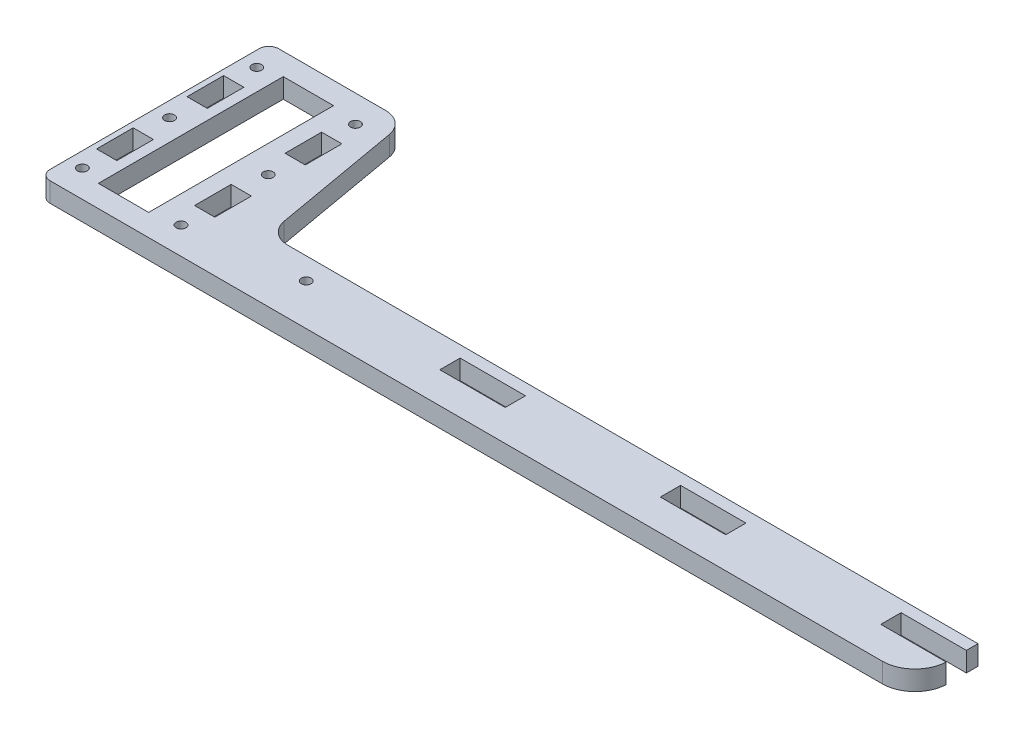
ISO-10303-21;
HEADER;
FILE_DESCRIPTION(('STEP AP214'),'2;1');
FILE_NAME('part.step','',(''),(''),'','','');
FILE_SCHEMA(('AUTOMOTIVE_DESIGN { 1 0 10303 214 1 1 1 1 }'));
ENDSEC;
DATA;
#1=APPLICATION_CONTEXT('core data for automotive mechanical design processes');
#2=APPLICATION_PROTOCOL_DEFINITION('international standard','automotive_design',2000,#1);
#3=PRODUCT_CONTEXT('',#1,'mechanical');
#4=PRODUCT('Part','Part','',(#3));
#5=PRODUCT_RELATED_PRODUCT_CATEGORY('part','',(#4));
#6=PRODUCT_DEFINITION_FORMATION('','',#4);
#7=PRODUCT_DEFINITION_CONTEXT('part definition',#1,'design');
#8=PRODUCT_DEFINITION('design','',#6,#7);
#9=PRODUCT_DEFINITION_SHAPE('','',#8);
#10=(LENGTH_UNIT() NAMED_UNIT(*) SI_UNIT(.MILLI.,.METRE.));
#11=(NAMED_UNIT(*) PLANE_ANGLE_UNIT() SI_UNIT($,.RADIAN.));
#12=(NAMED_UNIT(*) SI_UNIT($,.STERADIAN.) SOLID_ANGLE_UNIT());
#13=UNCERTAINTY_MEASURE_WITH_UNIT(LENGTH_MEASURE(1.E-05),#10,'distance_accuracy_value','');
#14=(GEOMETRIC_REPRESENTATION_CONTEXT(3) GLOBAL_UNCERTAINTY_ASSIGNED_CONTEXT((#13)) GLOBAL_UNIT_ASSIGNED_CONTEXT((#10,
#11,#12)) REPRESENTATION_CONTEXT('',''));
#15=CARTESIAN_POINT('',(0.,0.,0.));
#16=DIRECTION('',(0.,0.,1.));
#17=DIRECTION('',(1.,0.,0.));
#18=AXIS2_PLACEMENT_3D('',#15,#16,#17);
#19=CARTESIAN_POINT('',(0.,3.,0.));
#20=DIRECTION('',(0.,1.,0.));
#21=DIRECTION('',(0.,0.,1.));
#22=AXIS2_PLACEMENT_3D('',#19,#20,#21);
#23=PLANE('',#22);
#24=DIRECTION('',(-1.,0.,0.));
#25=VECTOR('',#24,1.);
#26=CARTESIAN_POINT('',(19.1,3.,-35.15));
#27=LINE('',#26,#25);
#28=CARTESIAN_POINT('',(12.9,3.,-35.15));
#29=VERTEX_POINT('',#28);
#30=CARTESIAN_POINT('',(19.1,3.,-35.15));
#31=VERTEX_POINT('',#30);
#32=EDGE_CURVE('E615',#29,#31,#27,.F.);
#33=ORIENTED_EDGE('',*,*,#32,.T.);
#34=DIRECTION('',(0.,0.,-1.));
#35=VECTOR('',#34,1.);
#36=CARTESIAN_POINT('',(19.1,3.,-23.95));
#37=LINE('',#36,#35);
#38=CARTESIAN_POINT('',(19.1,3.,-23.95));
#39=VERTEX_POINT('',#38);
#40=EDGE_CURVE('E635',#31,#39,#37,.F.);
#41=ORIENTED_EDGE('',*,*,#40,.T.);
#42=DIRECTION('',(1.,0.,0.));
#43=VECTOR('',#42,1.);
#44=CARTESIAN_POINT('',(12.9,3.,-23.95));
#45=LINE('',#44,#43);
#46=CARTESIAN_POINT('',(12.9,3.,-23.95));
#47=VERTEX_POINT('',#46);
#48=EDGE_CURVE('E628',#39,#47,#45,.F.);
#49=ORIENTED_EDGE('',*,*,#48,.T.);
#50=DIRECTION('',(0.,0.,1.));
#51=VECTOR('',#50,1.);
#52=CARTESIAN_POINT('',(12.9,3.,-35.15));
#53=LINE('',#52,#51);
#54=EDGE_CURVE('E621',#47,#29,#53,.F.);
#55=ORIENTED_EDGE('',*,*,#54,.T.);
#56=EDGE_LOOP('',(#33,#41,#49,#55));
#57=FACE_BOUND('',#56,.T.);
#58=DIRECTION('',(-1.,0.,0.));
#59=VECTOR('',#58,1.);
#60=CARTESIAN_POINT('',(19.1,3.,-7.45));
#61=LINE('',#60,#59);
#62=CARTESIAN_POINT('',(12.9,3.,-7.45));
#63=VERTEX_POINT('',#62);
#64=CARTESIAN_POINT('',(19.1,3.,-7.45));
#65=VERTEX_POINT('',#64);
#66=EDGE_CURVE('E642',#63,#65,#61,.F.);
#67=ORIENTED_EDGE('',*,*,#66,.T.);
#68=DIRECTION('',(0.,0.,-1.));
#69=VECTOR('',#68,1.);
#70=CARTESIAN_POINT('',(19.1,3.,3.75));
#71=LINE('',#70,#69);
#72=CARTESIAN_POINT('',(19.1,3.,3.75));
#73=VERTEX_POINT('',#72);
#74=EDGE_CURVE('E664',#65,#73,#71,.F.);
#75=ORIENTED_EDGE('',*,*,#74,.T.);
#76=DIRECTION('',(1.,0.,0.));
#77=VECTOR('',#76,1.);
#78=CARTESIAN_POINT('',(12.9,3.,3.75));
#79=LINE('',#78,#77);
#80=CARTESIAN_POINT('',(12.9,3.,3.75));
#81=VERTEX_POINT('',#80);
#82=EDGE_CURVE('E657',#73,#81,#79,.F.);
#83=ORIENTED_EDGE('',*,*,#82,.T.);
#84=DIRECTION('',(0.,0.,1.));
#85=VECTOR('',#84,1.);
#86=CARTESIAN_POINT('',(12.9,3.,-7.45));
#87=LINE('',#86,#85);
#88=EDGE_CURVE('E650',#81,#63,#87,.F.);
#89=ORIENTED_EDGE('',*,*,#88,.T.);
#90=EDGE_LOOP('',(#67,#75,#83,#89));
#91=FACE_BOUND('',#90,.T.);
#92=DIRECTION('',(1.,0.,0.));
#93=VECTOR('',#92,1.);
#94=CARTESIAN_POINT('',(-17.1,3.,3.75));
#95=LINE('',#94,#93);
#96=CARTESIAN_POINT('',(-10.9,3.,3.75));
#97=VERTEX_POINT('',#96);
#98=CARTESIAN_POINT('',(-17.1,3.,3.75));
#99=VERTEX_POINT('',#98);
#100=EDGE_CURVE('E671',#97,#99,#95,.F.);
#101=ORIENTED_EDGE('',*,*,#100,.T.);
#102=DIRECTION('',(0.,0.,1.));
#103=VECTOR('',#102,1.);
#104=CARTESIAN_POINT('',(-17.1,3.,-7.45));
#105=LINE('',#104,#103);
#106=CARTESIAN_POINT('',(-17.1,3.,-7.45));
#107=VERTEX_POINT('',#106);
#108=EDGE_CURVE('E693',#99,#107,#105,.F.);
#109=ORIENTED_EDGE('',*,*,#108,.T.);
#110=DIRECTION('',(-1.,0.,0.));
#111=VECTOR('',#110,1.);
#112=CARTESIAN_POINT('',(-10.9,3.,-7.45));
#113=LINE('',#112,#111);
#114=CARTESIAN_POINT('',(-10.9,3.,-7.45));
#115=VERTEX_POINT('',#114);
#116=EDGE_CURVE('E686',#107,#115,#113,.F.);
#117=ORIENTED_EDGE('',*,*,#116,.T.);
#118=DIRECTION('',(0.,0.,-1.));
#119=VECTOR('',#118,1.);
#120=CARTESIAN_POINT('',(-10.9,3.,3.75));
#121=LINE('',#120,#119);
#122=EDGE_CURVE('E679',#115,#97,#121,.F.);
#123=ORIENTED_EDGE('',*,*,#122,.T.);
#124=EDGE_LOOP('',(#101,#109,#117,#123));
#125=FACE_BOUND('',#124,.T.);
#126=DIRECTION('',(1.,0.,0.));
#127=VECTOR('',#126,1.);
#128=CARTESIAN_POINT('',(-17.1,3.,-23.95));
#129=LINE('',#128,#127);
#130=CARTESIAN_POINT('',(-10.9,3.,-23.95));
#131=VERTEX_POINT('',#130);
#132=CARTESIAN_POINT('',(-17.1,3.,-23.95));
#133=VERTEX_POINT('',#132);
#134=EDGE_CURVE('E700',#131,#133,#129,.F.);
#135=ORIENTED_EDGE('',*,*,#134,.T.);
#136=DIRECTION('',(0.,0.,1.));
#137=VECTOR('',#136,1.);
#138=CARTESIAN_POINT('',(-17.1,3.,-35.15));
#139=LINE('',#138,#137);
#140=CARTESIAN_POINT('',(-17.1,3.,-35.15));
#141=VERTEX_POINT('',#140);
#142=EDGE_CURVE('E722',#133,#141,#139,.F.);
#143=ORIENTED_EDGE('',*,*,#142,.T.);
#144=DIRECTION('',(-1.,0.,0.));
#145=VECTOR('',#144,1.);
#146=CARTESIAN_POINT('',(-10.9,3.,-35.15));
#147=LINE('',#146,#145);
#148=CARTESIAN_POINT('',(-10.9,3.,-35.15));
#149=VERTEX_POINT('',#148);
#150=EDGE_CURVE('E715',#141,#149,#147,.F.);
#151=ORIENTED_EDGE('',*,*,#150,.T.);
#152=DIRECTION('',(0.,0.,-1.));
#153=VECTOR('',#152,1.);
#154=CARTESIAN_POINT('',(-10.9,3.,-23.95));
#155=LINE('',#154,#153);
#156=EDGE_CURVE('E708',#149,#131,#155,.F.);
#157=ORIENTED_EDGE('',*,*,#156,.T.);
#158=EDGE_LOOP('',(#135,#143,#151,#157));
#159=FACE_BOUND('',#158,.T.);
#160=DIRECTION('',(1.,0.,0.));
#161=VECTOR('',#160,1.);
#162=CARTESIAN_POINT('',(-7.7,3.,12.6));
#163=LINE('',#162,#161);
#164=CARTESIAN_POINT('',(7.7,3.,12.6));
#165=VERTEX_POINT('',#164);
#166=CARTESIAN_POINT('',(-7.7,3.,12.6));
#167=VERTEX_POINT('',#166);
#168=EDGE_CURVE('E729',#165,#167,#163,.F.);
#169=ORIENTED_EDGE('',*,*,#168,.T.);
#170=DIRECTION('',(0.,0.,1.));
#171=VECTOR('',#170,1.);
#172=CARTESIAN_POINT('',(-7.7,3.,-44.));
#173=LINE('',#172,#171);
#174=CARTESIAN_POINT('',(-7.7,3.,-44.));
#175=VERTEX_POINT('',#174);
#176=EDGE_CURVE('E503',#167,#175,#173,.F.);
#177=ORIENTED_EDGE('',*,*,#176,.T.);
#178=DIRECTION('',(-1.,0.,0.));
#179=VECTOR('',#178,1.);
#180=CARTESIAN_POINT('',(7.7,3.,-44.));
#181=LINE('',#180,#179);
#182=CARTESIAN_POINT('',(7.7,3.,-44.));
#183=VERTEX_POINT('',#182);
#184=EDGE_CURVE('E743',#175,#183,#181,.F.);
#185=ORIENTED_EDGE('',*,*,#184,.T.);
#186=DIRECTION('',(0.,0.,-1.));
#187=VECTOR('',#186,1.);
#188=CARTESIAN_POINT('',(7.7,3.,12.6));
#189=LINE('',#188,#187);
#190=EDGE_CURVE('E737',#183,#165,#189,.F.);
#191=ORIENTED_EDGE('',*,*,#190,.T.);
#192=EDGE_LOOP('',(#169,#177,#185,#191));
#193=FACE_BOUND('',#192,.T.);
#194=CARTESIAN_POINT('',(-14.2,3.,11.));
#195=DIRECTION('',(0.,1.,0.));
#196=DIRECTION('',(0.,0.,1.));
#197=AXIS2_PLACEMENT_3D('',#194,#195,#196);
#198=CIRCLE('',#197,1.5);
#199=CARTESIAN_POINT('',(-14.2,3.,12.5));
#200=VERTEX_POINT('',#199);
#201=EDGE_CURVE('E499',#200,#200,#198,.F.);
#202=ORIENTED_EDGE('',*,*,#201,.T.);
#203=EDGE_LOOP('',(#202));
#204=FACE_BOUND('',#203,.T.);
#205=CARTESIAN_POINT('',(-14.2,3.,-15.7));
#206=DIRECTION('',(0.,1.,0.));
#207=DIRECTION('',(0.,0.,1.));
#208=AXIS2_PLACEMENT_3D('',#205,#206,#207);
#209=CIRCLE('',#208,1.5);
#210=CARTESIAN_POINT('',(-14.2,3.,-14.2));
#211=VERTEX_POINT('',#210);
#212=EDGE_CURVE('E504',#211,#211,#209,.F.);
#213=ORIENTED_EDGE('',*,*,#212,.T.);
#214=EDGE_LOOP('',(#213));
#215=FACE_BOUND('',#214,.T.);
#216=CARTESIAN_POINT('',(-14.2,3.,-42.4));
#217=DIRECTION('',(0.,1.,0.));
#218=DIRECTION('',(0.,0.,1.));
#219=AXIS2_PLACEMENT_3D('',#216,#217,#218);
#220=CIRCLE('',#219,1.5);
#221=CARTESIAN_POINT('',(-14.2,3.,-40.9));
#222=VERTEX_POINT('',#221);
#223=EDGE_CURVE('E508',#222,#222,#220,.F.);
#224=ORIENTED_EDGE('',*,*,#223,.T.);
#225=EDGE_LOOP('',(#224));
#226=FACE_BOUND('',#225,.T.);
#227=DIRECTION('',(0.,0.,-1.));
#228=VECTOR('',#227,1.);
#229=CARTESIAN_POINT('',(161.5,3.,9.75));
#230=LINE('',#229,#228);
#231=CARTESIAN_POINT('',(161.5,3.,3.55));
#232=VERTEX_POINT('',#231);
#233=CARTESIAN_POINT('',(161.5,3.,9.75));
#234=VERTEX_POINT('',#233);
#235=EDGE_CURVE('E754',#232,#234,#230,.F.);
#236=ORIENTED_EDGE('',*,*,#235,.F.);
#237=DIRECTION('',(1.,0.,0.));
#238=VECTOR('',#237,1.);
#239=CARTESIAN_POINT('',(161.5,3.,3.55));
#240=LINE('',#239,#238);
#241=CARTESIAN_POINT('',(181.5,3.,3.55));
#242=VERTEX_POINT('',#241);
#243=EDGE_CURVE('E773',#242,#232,#240,.F.);
#244=ORIENTED_EDGE('',*,*,#243,.F.);
#245=DIRECTION('',(0.,0.,1.));
#246=VECTOR('',#245,1.);
#247=CARTESIAN_POINT('',(181.5,3.,3.55));
#248=LINE('',#247,#246);
#249=CARTESIAN_POINT('',(181.5,3.,9.75));
#250=VERTEX_POINT('',#249);
#251=EDGE_CURVE('E770',#250,#242,#248,.F.);
#252=ORIENTED_EDGE('',*,*,#251,.F.);
#253=DIRECTION('',(-1.,0.,0.));
#254=VECTOR('',#253,1.);
#255=CARTESIAN_POINT('',(181.5,3.,9.75));
#256=LINE('',#255,#254);
#257=EDGE_CURVE('E764',#234,#250,#256,.F.);
#258=ORIENTED_EDGE('',*,*,#257,.F.);
#259=EDGE_LOOP('',(#236,#244,#252,#258));
#260=FACE_BOUND('',#259,.T.);
#261=DIRECTION('',(0.,0.,-1.));
#262=VECTOR('',#261,1.);
#263=CARTESIAN_POINT('',(94.,3.,9.75));
#264=LINE('',#263,#262);
#265=CARTESIAN_POINT('',(94.,3.,3.55));
#266=VERTEX_POINT('',#265);
#267=CARTESIAN_POINT('',(94.,3.,9.75));
#268=VERTEX_POINT('',#267);
#269=EDGE_CURVE('E779',#266,#268,#264,.F.);
#270=ORIENTED_EDGE('',*,*,#269,.F.);
#271=DIRECTION('',(1.,0.,0.));
#272=VECTOR('',#271,1.);
#273=CARTESIAN_POINT('',(94.,3.,3.55));
#274=LINE('',#273,#272);
#275=CARTESIAN_POINT('',(114.,3.,3.55));
#276=VERTEX_POINT('',#275);
#277=EDGE_CURVE('E517',#276,#266,#274,.F.);
#278=ORIENTED_EDGE('',*,*,#277,.F.);
#279=DIRECTION('',(0.,0.,1.));
#280=VECTOR('',#279,1.);
#281=CARTESIAN_POINT('',(114.,3.,3.55));
#282=LINE('',#281,#280);
#283=CARTESIAN_POINT('',(114.,3.,9.75));
#284=VERTEX_POINT('',#283);
#285=EDGE_CURVE('E795',#284,#276,#282,.F.);
#286=ORIENTED_EDGE('',*,*,#285,.F.);
#287=DIRECTION('',(-1.,0.,0.));
#288=VECTOR('',#287,1.);
#289=CARTESIAN_POINT('',(114.,3.,9.75));
#290=LINE('',#289,#288);
#291=EDGE_CURVE('E789',#268,#284,#290,.F.);
#292=ORIENTED_EDGE('',*,*,#291,.F.);
#293=EDGE_LOOP('',(#270,#278,#286,#292));
#294=FACE_BOUND('',#293,.T.);
#295=CARTESIAN_POINT('',(16.,3.,11.));
#296=DIRECTION('',(0.,1.,0.));
#297=DIRECTION('',(0.,0.,1.));
#298=AXIS2_PLACEMENT_3D('',#295,#296,#297);
#299=CIRCLE('',#298,1.5);
#300=CARTESIAN_POINT('',(16.,3.,12.5));
#301=VERTEX_POINT('',#300);
#302=EDGE_CURVE('E513',#301,#301,#299,.F.);
#303=ORIENTED_EDGE('',*,*,#302,.T.);
#304=EDGE_LOOP('',(#303));
#305=FACE_BOUND('',#304,.T.);
#306=CARTESIAN_POINT('',(16.,3.,-15.7));
#307=DIRECTION('',(0.,1.,0.));
#308=DIRECTION('',(0.,0.,1.));
#309=AXIS2_PLACEMENT_3D('',#306,#307,#308);
#310=CIRCLE('',#309,1.5);
#311=CARTESIAN_POINT('',(16.,3.,-14.2));
#312=VERTEX_POINT('',#311);
#313=EDGE_CURVE('E518',#312,#312,#310,.F.);
#314=ORIENTED_EDGE('',*,*,#313,.T.);
#315=EDGE_LOOP('',(#314));
#316=FACE_BOUND('',#315,.T.);
#317=CARTESIAN_POINT('',(16.,3.,-42.4));
#318=DIRECTION('',(0.,1.,0.));
#319=DIRECTION('',(0.,0.,1.));
#320=AXIS2_PLACEMENT_3D('',#317,#318,#319);
#321=CIRCLE('',#320,1.5);
#322=CARTESIAN_POINT('',(16.,3.,-40.9));
#323=VERTEX_POINT('',#322);
#324=EDGE_CURVE('E522',#323,#323,#321,.F.);
#325=ORIENTED_EDGE('',*,*,#324,.T.);
#326=EDGE_LOOP('',(#325));
#327=FACE_BOUND('',#326,.T.);
#328=CARTESIAN_POINT('',(50.,3.,6.65));
#329=DIRECTION('',(0.,1.,0.));
#330=DIRECTION('',(0.,0.,1.));
#331=AXIS2_PLACEMENT_3D('',#328,#329,#330);
#332=CIRCLE('',#331,1.5);
#333=CARTESIAN_POINT('',(50.,3.,8.15));
#334=VERTEX_POINT('',#333);
#335=EDGE_CURVE('E399',#334,#334,#332,.F.);
#336=ORIENTED_EDGE('',*,*,#335,.T.);
#337=EDGE_LOOP('',(#336));
#338=FACE_BOUND('',#337,.T.);
#339=DIRECTION('',(-1.,0.,0.));
#340=VECTOR('',#339,1.);
#341=CARTESIAN_POINT('',(249.,3.,0.));
#342=LINE('',#341,#340);
#343=CARTESIAN_POINT('',(37.67369741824,3.,0.));
#344=VERTEX_POINT('',#343);
#345=CARTESIAN_POINT('',(249.,3.,0.));
#346=VERTEX_POINT('',#345);
#347=EDGE_CURVE('E382',#344,#346,#342,.F.);
#348=ORIENTED_EDGE('',*,*,#347,.F.);
#349=CARTESIAN_POINT('',(37.67369741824,3.,-7.));
#350=DIRECTION('',(0.,1.,0.));
#351=DIRECTION('',(0.,0.,1.));
#352=AXIS2_PLACEMENT_3D('',#349,#350,#351);
#353=CIRCLE('',#352,7.);
#354=CARTESIAN_POINT('',(30.7800431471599,3.,-5.7844627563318));
#355=VERTEX_POINT('',#354);
#356=EDGE_CURVE('E20',#344,#355,#353,.F.);
#357=ORIENTED_EDGE('',*,*,#356,.T.);
#358=DIRECTION('',(-0.173648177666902,0.,-0.984807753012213));
#359=VECTOR('',#358,1.);
#360=CARTESIAN_POINT('',(30.78004314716,3.,-5.784462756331));
#361=LINE('',#360,#359);
#362=CARTESIAN_POINT('',(23.880178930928,3.,-44.9155372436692));
#363=VERTEX_POINT('',#362);
#364=EDGE_CURVE('E379',#363,#355,#361,.F.);
#365=ORIENTED_EDGE('',*,*,#364,.F.);
#366=CARTESIAN_POINT('',(16.98652465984,3.,-43.7));
#367=DIRECTION('',(0.,1.,0.));
#368=DIRECTION('',(0.,0.,1.));
#369=AXIS2_PLACEMENT_3D('',#366,#367,#368);
#370=CIRCLE('',#369,7.);
#371=CARTESIAN_POINT('',(16.98652465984,3.,-50.7));
#372=VERTEX_POINT('',#371);
#373=EDGE_CURVE('E536',#372,#363,#370,.F.);
#374=ORIENTED_EDGE('',*,*,#373,.F.);
#375=DIRECTION('',(-1.,0.,0.));
#376=VECTOR('',#375,1.);
#377=CARTESIAN_POINT('',(16.98652465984,3.,-50.7));
#378=LINE('',#377,#376);
#379=CARTESIAN_POINT('',(-15.8,3.,-50.7));
#380=VERTEX_POINT('',#379);
#381=EDGE_CURVE('E436',#380,#372,#378,.F.);
#382=ORIENTED_EDGE('',*,*,#381,.F.);
#383=CARTESIAN_POINT('',(-15.8,3.,-47.7));
#384=DIRECTION('',(0.,1.,0.));
#385=DIRECTION('',(0.,0.,1.));
#386=AXIS2_PLACEMENT_3D('',#383,#384,#385);
#387=CIRCLE('',#386,3.);
#388=CARTESIAN_POINT('',(-18.8,3.,-47.7));
#389=VERTEX_POINT('',#388);
#390=EDGE_CURVE('E534',#389,#380,#387,.F.);
#391=ORIENTED_EDGE('',*,*,#390,.F.);
#392=DIRECTION('',(0.,0.,1.));
#393=VECTOR('',#392,1.);
#394=CARTESIAN_POINT('',(-18.8,3.,-47.7));
#395=LINE('',#394,#393);
#396=CARTESIAN_POINT('',(-18.8,3.,16.3));
#397=VERTEX_POINT('',#396);
#398=EDGE_CURVE('E431',#397,#389,#395,.F.);
#399=ORIENTED_EDGE('',*,*,#398,.F.);
#400=CARTESIAN_POINT('',(-15.8,3.,16.3));
#401=DIRECTION('',(0.,1.,0.));
#402=DIRECTION('',(0.,0.,1.));
#403=AXIS2_PLACEMENT_3D('',#400,#401,#402);
#404=CIRCLE('',#403,3.);
#405=CARTESIAN_POINT('',(-15.8,3.,19.3));
#406=VERTEX_POINT('',#405);
#407=EDGE_CURVE('E531',#406,#397,#404,.F.);
#408=ORIENTED_EDGE('',*,*,#407,.F.);
#409=DIRECTION('',(1.,0.,0.));
#410=VECTOR('',#409,1.);
#411=CARTESIAN_POINT('',(-15.8,3.,19.3));
#412=LINE('',#411,#410);
#413=CARTESIAN_POINT('',(239.,3.,19.3));
#414=VERTEX_POINT('',#413);
#415=EDGE_CURVE('E426',#414,#406,#412,.F.);
#416=ORIENTED_EDGE('',*,*,#415,.F.);
#417=CARTESIAN_POINT('',(239.,3.,9.3));
#418=DIRECTION('',(0.,1.,0.));
#419=DIRECTION('',(0.,0.,1.));
#420=AXIS2_PLACEMENT_3D('',#417,#418,#419);
#421=CIRCLE('',#420,10.);
#422=CARTESIAN_POINT('',(248.989869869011,3.,9.75));
#423=VERTEX_POINT('',#422);
#424=EDGE_CURVE('E528',#423,#414,#421,.F.);
#425=ORIENTED_EDGE('',*,*,#424,.F.);
#426=DIRECTION('',(-1.,0.,0.));
#427=VECTOR('',#426,1.);
#428=CARTESIAN_POINT('',(248.989869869,3.,9.75));
#429=LINE('',#428,#427);
#430=CARTESIAN_POINT('',(229.,3.,9.75));
#431=VERTEX_POINT('',#430);
#432=EDGE_CURVE('E420',#431,#423,#429,.F.);
#433=ORIENTED_EDGE('',*,*,#432,.F.);
#434=DIRECTION('',(0.,0.,-1.));
#435=VECTOR('',#434,1.);
#436=CARTESIAN_POINT('',(229.,3.,9.75));
#437=LINE('',#436,#435);
#438=CARTESIAN_POINT('',(229.,3.,3.55));
#439=VERTEX_POINT('',#438);
#440=EDGE_CURVE('E414',#439,#431,#437,.F.);
#441=ORIENTED_EDGE('',*,*,#440,.F.);
#442=DIRECTION('',(1.,0.,0.));
#443=VECTOR('',#442,1.);
#444=CARTESIAN_POINT('',(229.,3.,3.55));
#445=LINE('',#444,#443);
#446=CARTESIAN_POINT('',(249.,3.,3.55));
#447=VERTEX_POINT('',#446);
#448=EDGE_CURVE('E407',#447,#439,#445,.F.);
#449=ORIENTED_EDGE('',*,*,#448,.F.);
#450=DIRECTION('',(0.,0.,-1.));
#451=VECTOR('',#450,1.);
#452=CARTESIAN_POINT('',(249.,3.,3.55));
#453=LINE('',#452,#451);
#454=EDGE_CURVE('E390',#346,#447,#453,.F.);
#455=ORIENTED_EDGE('',*,*,#454,.F.);
#456=EDGE_LOOP('',(#348,#357,#365,#374,#382,#391,#399,#408,#416,#425,#433,#441,#449,#455));
#457=FACE_BOUND('',#456,.T.);
#458=ADVANCED_FACE('F17',(#57,#91,#125,#159,#193,#204,#215,#226,#260,#294,#305,#316,#327,#338,
#457),#23,.T.);
#459=CARTESIAN_POINT('',(37.67369741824,-3.,-7.));
#460=DIRECTION('',(0.,1.,0.));
#461=DIRECTION('',(0.,0.,1.));
#462=AXIS2_PLACEMENT_3D('',#459,#460,#461);
#463=CYLINDRICAL_SURFACE('',#462,7.);
#464=ORIENTED_EDGE('',*,*,#356,.F.);
#465=DIRECTION('',(0.,1.,0.));
#466=VECTOR('',#465,1.);
#467=CARTESIAN_POINT('',(37.67369741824,-3.,0.));
#468=LINE('',#467,#466);
#469=CARTESIAN_POINT('',(37.67369741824,-3.,0.));
#470=VERTEX_POINT('',#469);
#471=EDGE_CURVE('E372',#470,#344,#468,.T.);
#472=ORIENTED_EDGE('',*,*,#471,.F.);
#473=CARTESIAN_POINT('',(37.67369741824,-3.,-7.));
#474=DIRECTION('',(0.,1.,0.));
#475=DIRECTION('',(0.,0.,1.));
#476=AXIS2_PLACEMENT_3D('',#473,#474,#475);
#477=CIRCLE('',#476,7.);
#478=CARTESIAN_POINT('',(30.7800431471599,-3.,-5.78446275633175));
#479=VERTEX_POINT('',#478);
#480=EDGE_CURVE('E496',#470,#479,#477,.F.);
#481=ORIENTED_EDGE('',*,*,#480,.T.);
#482=DIRECTION('',(0.,1.,0.));
#483=VECTOR('',#482,1.);
#484=CARTESIAN_POINT('',(30.78004314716,-3.,-5.784462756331));
#485=LINE('',#484,#483);
#486=EDGE_CURVE('E374',#355,#479,#485,.F.);
#487=ORIENTED_EDGE('',*,*,#486,.F.);
#488=EDGE_LOOP('',(#464,#472,#481,#487));
#489=FACE_BOUND('',#488,.T.);
#490=ADVANCED_FACE('F370',(#489),#463,.F.);
#491=CARTESIAN_POINT('',(30.78004314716,-3.,-5.784462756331));
#492=DIRECTION('',(0.984807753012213,0.,-0.173648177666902));
#493=DIRECTION('',(-0.173648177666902,0.,-0.984807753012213));
#494=AXIS2_PLACEMENT_3D('',#491,#492,#493);
#495=PLANE('',#494);
#496=ORIENTED_EDGE('',*,*,#486,.T.);
#497=DIRECTION('',(-0.173648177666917,0.,-0.98480775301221));
#498=VECTOR('',#497,1.);
#499=CARTESIAN_POINT('',(30.78004314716,-3.,-5.784462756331));
#500=LINE('',#499,#498);
#501=CARTESIAN_POINT('',(23.8801789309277,-3.,-44.9155372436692));
#502=VERTEX_POINT('',#501);
#503=EDGE_CURVE('E495',#479,#502,#500,.T.);
#504=ORIENTED_EDGE('',*,*,#503,.T.);
#505=DIRECTION('',(0.,1.,0.));
#506=VECTOR('',#505,1.);
#507=CARTESIAN_POINT('',(23.8801789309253,-3.,-44.9155372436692));
#508=LINE('',#507,#506);
#509=EDGE_CURVE('E440',#363,#502,#508,.F.);
#510=ORIENTED_EDGE('',*,*,#509,.F.);
#511=ORIENTED_EDGE('',*,*,#364,.T.);
#512=EDGE_LOOP('',(#496,#504,#510,#511));
#513=FACE_BOUND('',#512,.T.);
#514=ADVANCED_FACE('F608',(#513),#495,.T.);
#515=CARTESIAN_POINT('',(16.98652465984,-3.,-43.7));
#516=DIRECTION('',(0.,1.,0.));
#517=DIRECTION('',(0.,0.,1.));
#518=AXIS2_PLACEMENT_3D('',#515,#516,#517);
#519=CYLINDRICAL_SURFACE('',#518,7.);
#520=ORIENTED_EDGE('',*,*,#509,.T.);
#521=CARTESIAN_POINT('',(16.98652465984,-3.,-43.7));
#522=DIRECTION('',(0.,1.,0.));
#523=DIRECTION('',(0.,0.,1.));
#524=AXIS2_PLACEMENT_3D('',#521,#522,#523);
#525=CIRCLE('',#524,7.);
#526=CARTESIAN_POINT('',(16.98652465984,-3.,-50.7));
#527=VERTEX_POINT('',#526);
#528=EDGE_CURVE('E491',#502,#527,#525,.T.);
#529=ORIENTED_EDGE('',*,*,#528,.T.);
#530=DIRECTION('',(0.,1.,0.));
#531=VECTOR('',#530,1.);
#532=CARTESIAN_POINT('',(16.98652465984,-3.,-50.7));
#533=LINE('',#532,#531);
#534=EDGE_CURVE('E439',#372,#527,#533,.F.);
#535=ORIENTED_EDGE('',*,*,#534,.F.);
#536=ORIENTED_EDGE('',*,*,#373,.T.);
#537=EDGE_LOOP('',(#520,#529,#535,#536));
#538=FACE_BOUND('',#537,.T.);
#539=ADVANCED_FACE('F606',(#538),#519,.T.);
#540=CARTESIAN_POINT('',(16.98652465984,-3.,-50.7));
#541=DIRECTION('',(0.,0.,-1.));
#542=DIRECTION('',(-1.,0.,0.));
#543=AXIS2_PLACEMENT_3D('',#540,#541,#542);
#544=PLANE('',#543);
#545=ORIENTED_EDGE('',*,*,#534,.T.);
#546=DIRECTION('',(1.,0.,0.));
#547=VECTOR('',#546,1.);
#548=CARTESIAN_POINT('',(0.,-3.,-50.7));
#549=LINE('',#548,#547);
#550=CARTESIAN_POINT('',(-15.8,-3.,-50.7));
#551=VERTEX_POINT('',#550);
#552=EDGE_CURVE('E490',#527,#551,#549,.F.);
#553=ORIENTED_EDGE('',*,*,#552,.T.);
#554=DIRECTION('',(0.,1.,0.));
#555=VECTOR('',#554,1.);
#556=CARTESIAN_POINT('',(-15.8,-3.,-50.7));
#557=LINE('',#556,#555);
#558=EDGE_CURVE('E435',#380,#551,#557,.F.);
#559=ORIENTED_EDGE('',*,*,#558,.F.);
#560=ORIENTED_EDGE('',*,*,#381,.T.);
#561=EDGE_LOOP('',(#545,#553,#559,#560));
#562=FACE_BOUND('',#561,.T.);
#563=ADVANCED_FACE('F595',(#562),#544,.T.);
#564=CARTESIAN_POINT('',(-15.8,-3.,-47.7));
#565=DIRECTION('',(0.,1.,0.));
#566=DIRECTION('',(0.,0.,1.));
#567=AXIS2_PLACEMENT_3D('',#564,#565,#566);
#568=CYLINDRICAL_SURFACE('',#567,3.);
#569=ORIENTED_EDGE('',*,*,#558,.T.);
#570=CARTESIAN_POINT('',(-15.8,-3.,-47.7));
#571=DIRECTION('',(0.,1.,0.));
#572=DIRECTION('',(0.,0.,1.));
#573=AXIS2_PLACEMENT_3D('',#570,#571,#572);
#574=CIRCLE('',#573,3.);
#575=CARTESIAN_POINT('',(-18.8,-3.,-47.7));
#576=VERTEX_POINT('',#575);
#577=EDGE_CURVE('E486',#551,#576,#574,.T.);
#578=ORIENTED_EDGE('',*,*,#577,.T.);
#579=DIRECTION('',(0.,1.,0.));
#580=VECTOR('',#579,1.);
#581=CARTESIAN_POINT('',(-18.8,-3.,-47.7));
#582=LINE('',#581,#580);
#583=EDGE_CURVE('E434',#389,#576,#582,.F.);
#584=ORIENTED_EDGE('',*,*,#583,.F.);
#585=ORIENTED_EDGE('',*,*,#390,.T.);
#586=EDGE_LOOP('',(#569,#578,#584,#585));
#587=FACE_BOUND('',#586,.T.);
#588=ADVANCED_FACE('F843',(#587),#568,.T.);
#589=CARTESIAN_POINT('',(-18.8,-3.,-47.7));
#590=DIRECTION('',(-1.,0.,0.));
#591=DIRECTION('',(0.,0.,1.));
#592=AXIS2_PLACEMENT_3D('',#589,#590,#591);
#593=PLANE('',#592);
#594=ORIENTED_EDGE('',*,*,#583,.T.);
#595=DIRECTION('',(0.,0.,1.));
#596=VECTOR('',#595,1.);
#597=CARTESIAN_POINT('',(-18.8,-3.,0.));
#598=LINE('',#597,#596);
#599=CARTESIAN_POINT('',(-18.8,-3.,16.3));
#600=VERTEX_POINT('',#599);
#601=EDGE_CURVE('E485',#576,#600,#598,.T.);
#602=ORIENTED_EDGE('',*,*,#601,.T.);
#603=DIRECTION('',(0.,1.,0.));
#604=VECTOR('',#603,1.);
#605=CARTESIAN_POINT('',(-18.8,-3.,16.3));
#606=LINE('',#605,#604);
#607=EDGE_CURVE('E430',#397,#600,#606,.F.);
#608=ORIENTED_EDGE('',*,*,#607,.F.);
#609=ORIENTED_EDGE('',*,*,#398,.T.);
#610=EDGE_LOOP('',(#594,#602,#608,#609));
#611=FACE_BOUND('',#610,.T.);
#612=ADVANCED_FACE('F838',(#611),#593,.T.);
#613=CARTESIAN_POINT('',(-15.8,-3.,16.3));
#614=DIRECTION('',(0.,1.,0.));
#615=DIRECTION('',(0.,0.,1.));
#616=AXIS2_PLACEMENT_3D('',#613,#614,#615);
#617=CYLINDRICAL_SURFACE('',#616,3.);
#618=ORIENTED_EDGE('',*,*,#607,.T.);
#619=CARTESIAN_POINT('',(-15.8,-3.,16.3));
#620=DIRECTION('',(0.,1.,0.));
#621=DIRECTION('',(0.,0.,1.));
#622=AXIS2_PLACEMENT_3D('',#619,#620,#621);
#623=CIRCLE('',#622,3.);
#624=CARTESIAN_POINT('',(-15.8,-3.,19.3));
#625=VERTEX_POINT('',#624);
#626=EDGE_CURVE('E481',#600,#625,#623,.T.);
#627=ORIENTED_EDGE('',*,*,#626,.T.);
#628=DIRECTION('',(0.,1.,0.));
#629=VECTOR('',#628,1.);
#630=CARTESIAN_POINT('',(-15.8,-3.,19.3));
#631=LINE('',#630,#629);
#632=EDGE_CURVE('E429',#406,#625,#631,.F.);
#633=ORIENTED_EDGE('',*,*,#632,.F.);
#634=ORIENTED_EDGE('',*,*,#407,.T.);
#635=EDGE_LOOP('',(#618,#627,#633,#634));
#636=FACE_BOUND('',#635,.T.);
#637=ADVANCED_FACE('F851',(#636),#617,.T.);
#638=CARTESIAN_POINT('',(-15.8,-3.,19.3));
#639=DIRECTION('',(0.,0.,1.));
#640=DIRECTION('',(1.,0.,0.));
#641=AXIS2_PLACEMENT_3D('',#638,#639,#640);
#642=PLANE('',#641);
#643=ORIENTED_EDGE('',*,*,#632,.T.);
#644=DIRECTION('',(1.,0.,0.));
#645=VECTOR('',#644,1.);
#646=CARTESIAN_POINT('',(0.,-3.,19.3));
#647=LINE('',#646,#645);
#648=CARTESIAN_POINT('',(239.,-3.,19.3));
#649=VERTEX_POINT('',#648);
#650=EDGE_CURVE('E480',#625,#649,#647,.T.);
#651=ORIENTED_EDGE('',*,*,#650,.T.);
#652=DIRECTION('',(0.,1.,0.));
#653=VECTOR('',#652,1.);
#654=CARTESIAN_POINT('',(239.,-3.,19.3));
#655=LINE('',#654,#653);
#656=EDGE_CURVE('E423',#414,#649,#655,.F.);
#657=ORIENTED_EDGE('',*,*,#656,.F.);
#658=ORIENTED_EDGE('',*,*,#415,.T.);
#659=EDGE_LOOP('',(#643,#651,#657,#658));
#660=FACE_BOUND('',#659,.T.);
#661=ADVANCED_FACE('F853',(#660),#642,.T.);
#662=CARTESIAN_POINT('',(239.,-3.,9.3));
#663=DIRECTION('',(0.,1.,0.));
#664=DIRECTION('',(0.,0.,1.));
#665=AXIS2_PLACEMENT_3D('',#662,#663,#664);
#666=CYLINDRICAL_SURFACE('',#665,10.);
#667=ORIENTED_EDGE('',*,*,#656,.T.);
#668=CARTESIAN_POINT('',(239.,-3.,9.3));
#669=DIRECTION('',(0.,1.,0.));
#670=DIRECTION('',(0.,0.,1.));
#671=AXIS2_PLACEMENT_3D('',#668,#669,#670);
#672=CIRCLE('',#671,10.);
#673=CARTESIAN_POINT('',(248.989869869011,-3.,9.75));
#674=VERTEX_POINT('',#673);
#675=EDGE_CURVE('E475',#649,#674,#672,.T.);
#676=ORIENTED_EDGE('',*,*,#675,.T.);
#677=DIRECTION('',(0.,1.,0.));
#678=VECTOR('',#677,1.);
#679=CARTESIAN_POINT('',(248.989869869,-3.,9.75));
#680=LINE('',#679,#678);
#681=EDGE_CURVE('E417',#423,#674,#680,.F.);
#682=ORIENTED_EDGE('',*,*,#681,.F.);
#683=ORIENTED_EDGE('',*,*,#424,.T.);
#684=EDGE_LOOP('',(#667,#676,#682,#683));
#685=FACE_BOUND('',#684,.T.);
#686=ADVANCED_FACE('F855',(#685),#666,.T.);
#687=CARTESIAN_POINT('',(248.989869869,-3.,9.75));
#688=DIRECTION('',(0.,0.,-1.));
#689=DIRECTION('',(-1.,0.,0.));
#690=AXIS2_PLACEMENT_3D('',#687,#688,#689);
#691=PLANE('',#690);
#692=ORIENTED_EDGE('',*,*,#681,.T.);
#693=DIRECTION('',(1.,0.,0.));
#694=VECTOR('',#693,1.);
#695=CARTESIAN_POINT('',(0.,-3.,9.75));
#696=LINE('',#695,#694);
#697=CARTESIAN_POINT('',(229.,-3.,9.75));
#698=VERTEX_POINT('',#697);
#699=EDGE_CURVE('E479',#674,#698,#696,.F.);
#700=ORIENTED_EDGE('',*,*,#699,.T.);
#701=DIRECTION('',(0.,1.,0.));
#702=VECTOR('',#701,1.);
#703=CARTESIAN_POINT('',(229.,-3.,9.75));
#704=LINE('',#703,#702);
#705=EDGE_CURVE('E411',#431,#698,#704,.F.);
#706=ORIENTED_EDGE('',*,*,#705,.F.);
#707=ORIENTED_EDGE('',*,*,#432,.T.);
#708=EDGE_LOOP('',(#692,#700,#706,#707));
#709=FACE_BOUND('',#708,.T.);
#710=ADVANCED_FACE('F820',(#709),#691,.T.);
#711=CARTESIAN_POINT('',(229.,-3.,9.75));
#712=DIRECTION('',(1.,0.,0.));
#713=DIRECTION('',(0.,0.,-1.));
#714=AXIS2_PLACEMENT_3D('',#711,#712,#713);
#715=PLANE('',#714);
#716=ORIENTED_EDGE('',*,*,#705,.T.);
#717=DIRECTION('',(0.,0.,1.));
#718=VECTOR('',#717,1.);
#719=CARTESIAN_POINT('',(229.,-3.,0.));
#720=LINE('',#719,#718);
#721=CARTESIAN_POINT('',(229.,-3.,3.55));
#722=VERTEX_POINT('',#721);
#723=EDGE_CURVE('E570',#698,#722,#720,.F.);
#724=ORIENTED_EDGE('',*,*,#723,.T.);
#725=DIRECTION('',(0.,1.,0.));
#726=VECTOR('',#725,1.);
#727=CARTESIAN_POINT('',(229.,-3.,3.55));
#728=LINE('',#727,#726);
#729=EDGE_CURVE('E410',#439,#722,#728,.F.);
#730=ORIENTED_EDGE('',*,*,#729,.F.);
#731=ORIENTED_EDGE('',*,*,#440,.T.);
#732=EDGE_LOOP('',(#716,#724,#730,#731));
#733=FACE_BOUND('',#732,.T.);
#734=ADVANCED_FACE('F815',(#733),#715,.T.);
#735=CARTESIAN_POINT('',(229.,-3.,3.55));
#736=DIRECTION('',(0.,0.,1.));
#737=DIRECTION('',(1.,0.,0.));
#738=AXIS2_PLACEMENT_3D('',#735,#736,#737);
#739=PLANE('',#738);
#740=ORIENTED_EDGE('',*,*,#729,.T.);
#741=DIRECTION('',(1.,0.,0.));
#742=VECTOR('',#741,1.);
#743=CARTESIAN_POINT('',(0.,-3.,3.55));
#744=LINE('',#743,#742);
#745=CARTESIAN_POINT('',(249.,-3.,3.55));
#746=VERTEX_POINT('',#745);
#747=EDGE_CURVE('E573',#722,#746,#744,.T.);
#748=ORIENTED_EDGE('',*,*,#747,.T.);
#749=DIRECTION('',(0.,1.,0.));
#750=VECTOR('',#749,1.);
#751=CARTESIAN_POINT('',(249.,-3.,3.55));
#752=LINE('',#751,#750);
#753=EDGE_CURVE('E387',#447,#746,#752,.F.);
#754=ORIENTED_EDGE('',*,*,#753,.F.);
#755=ORIENTED_EDGE('',*,*,#448,.T.);
#756=EDGE_LOOP('',(#740,#748,#754,#755));
#757=FACE_BOUND('',#756,.T.);
#758=ADVANCED_FACE('F810',(#757),#739,.T.);
#759=CARTESIAN_POINT('',(249.,-3.,3.55));
#760=DIRECTION('',(1.,0.,0.));
#761=DIRECTION('',(0.,0.,-1.));
#762=AXIS2_PLACEMENT_3D('',#759,#760,#761);
#763=PLANE('',#762);
#764=ORIENTED_EDGE('',*,*,#753,.T.);
#765=DIRECTION('',(0.,0.,1.));
#766=VECTOR('',#765,1.);
#767=CARTESIAN_POINT('',(249.,-3.,0.));
#768=LINE('',#767,#766);
#769=CARTESIAN_POINT('',(249.,-3.,0.));
#770=VERTEX_POINT('',#769);
#771=EDGE_CURVE('E802',#746,#770,#768,.F.);
#772=ORIENTED_EDGE('',*,*,#771,.T.);
#773=DIRECTION('',(0.,1.,0.));
#774=VECTOR('',#773,1.);
#775=CARTESIAN_POINT('',(249.,-3.,0.));
#776=LINE('',#775,#774);
#777=EDGE_CURVE('E393',#346,#770,#776,.F.);
#778=ORIENTED_EDGE('',*,*,#777,.F.);
#779=ORIENTED_EDGE('',*,*,#454,.T.);
#780=EDGE_LOOP('',(#764,#772,#778,#779));
#781=FACE_BOUND('',#780,.T.);
#782=ADVANCED_FACE('F1015',(#781),#763,.T.);
#783=CARTESIAN_POINT('',(249.,-3.,0.));
#784=DIRECTION('',(0.,0.,-1.));
#785=DIRECTION('',(-1.,0.,0.));
#786=AXIS2_PLACEMENT_3D('',#783,#784,#785);
#787=PLANE('',#786);
#788=ORIENTED_EDGE('',*,*,#777,.T.);
#789=DIRECTION('',(1.,0.,0.));
#790=VECTOR('',#789,1.);
#791=CARTESIAN_POINT('',(0.,-3.,0.));
#792=LINE('',#791,#790);
#793=EDGE_CURVE('E385',#770,#470,#792,.F.);
#794=ORIENTED_EDGE('',*,*,#793,.T.);
#795=ORIENTED_EDGE('',*,*,#471,.T.);
#796=ORIENTED_EDGE('',*,*,#347,.T.);
#797=EDGE_LOOP('',(#788,#794,#795,#796));
#798=FACE_BOUND('',#797,.T.);
#799=ADVANCED_FACE('F381',(#798),#787,.T.);
#800=CARTESIAN_POINT('',(50.,-3.,6.65));
#801=DIRECTION('',(0.,1.,0.));
#802=DIRECTION('',(0.,0.,1.));
#803=AXIS2_PLACEMENT_3D('',#800,#801,#802);
#804=CYLINDRICAL_SURFACE('',#803,1.5);
#805=ORIENTED_EDGE('',*,*,#335,.F.);
#806=EDGE_LOOP('',(#805));
#807=FACE_BOUND('',#806,.T.);
#808=CARTESIAN_POINT('',(50.,-3.,6.65));
#809=DIRECTION('',(0.,1.,0.));
#810=DIRECTION('',(0.,0.,1.));
#811=AXIS2_PLACEMENT_3D('',#808,#809,#810);
#812=CIRCLE('',#811,1.5);
#813=CARTESIAN_POINT('',(50.,-3.,8.15));
#814=VERTEX_POINT('',#813);
#815=EDGE_CURVE('E471',#814,#814,#812,.F.);
#816=ORIENTED_EDGE('',*,*,#815,.T.);
#817=EDGE_LOOP('',(#816));
#818=FACE_BOUND('',#817,.T.);
#819=ADVANCED_FACE('F1008',(#807,#818),#804,.F.);
#820=CARTESIAN_POINT('',(16.,-3.,-42.4));
#821=DIRECTION('',(0.,1.,0.));
#822=DIRECTION('',(0.,0.,1.));
#823=AXIS2_PLACEMENT_3D('',#820,#821,#822);
#824=CYLINDRICAL_SURFACE('',#823,1.5);
#825=ORIENTED_EDGE('',*,*,#324,.F.);
#826=EDGE_LOOP('',(#825));
#827=FACE_BOUND('',#826,.T.);
#828=CARTESIAN_POINT('',(16.,-3.,-42.4));
#829=DIRECTION('',(0.,1.,0.));
#830=DIRECTION('',(0.,0.,1.));
#831=AXIS2_PLACEMENT_3D('',#828,#829,#830);
#832=CIRCLE('',#831,1.5);
#833=CARTESIAN_POINT('',(16.,-3.,-40.9));
#834=VERTEX_POINT('',#833);
#835=EDGE_CURVE('E467',#834,#834,#832,.F.);
#836=ORIENTED_EDGE('',*,*,#835,.T.);
#837=EDGE_LOOP('',(#836));
#838=FACE_BOUND('',#837,.T.);
#839=ADVANCED_FACE('F1004',(#827,#838),#824,.F.);
#840=CARTESIAN_POINT('',(16.,-3.,-15.7));
#841=DIRECTION('',(0.,1.,0.));
#842=DIRECTION('',(0.,0.,1.));
#843=AXIS2_PLACEMENT_3D('',#840,#841,#842);
#844=CYLINDRICAL_SURFACE('',#843,1.5);
#845=ORIENTED_EDGE('',*,*,#313,.F.);
#846=EDGE_LOOP('',(#845));
#847=FACE_BOUND('',#846,.T.);
#848=CARTESIAN_POINT('',(16.,-3.,-15.7));
#849=DIRECTION('',(0.,1.,0.));
#850=DIRECTION('',(0.,0.,1.));
#851=AXIS2_PLACEMENT_3D('',#848,#849,#850);
#852=CIRCLE('',#851,1.5);
#853=CARTESIAN_POINT('',(16.,-3.,-14.2));
#854=VERTEX_POINT('',#853);
#855=EDGE_CURVE('E463',#854,#854,#852,.F.);
#856=ORIENTED_EDGE('',*,*,#855,.T.);
#857=EDGE_LOOP('',(#856));
#858=FACE_BOUND('',#857,.T.);
#859=ADVANCED_FACE('F1000',(#847,#858),#844,.F.);
#860=CARTESIAN_POINT('',(16.,-3.,11.));
#861=DIRECTION('',(0.,1.,0.));
#862=DIRECTION('',(0.,0.,1.));
#863=AXIS2_PLACEMENT_3D('',#860,#861,#862);
#864=CYLINDRICAL_SURFACE('',#863,1.5);
#865=ORIENTED_EDGE('',*,*,#302,.F.);
#866=EDGE_LOOP('',(#865));
#867=FACE_BOUND('',#866,.T.);
#868=CARTESIAN_POINT('',(16.,-3.,11.));
#869=DIRECTION('',(0.,1.,0.));
#870=DIRECTION('',(0.,0.,1.));
#871=AXIS2_PLACEMENT_3D('',#868,#869,#870);
#872=CIRCLE('',#871,1.5);
#873=CARTESIAN_POINT('',(16.,-3.,12.5));
#874=VERTEX_POINT('',#873);
#875=EDGE_CURVE('E458',#874,#874,#872,.F.);
#876=ORIENTED_EDGE('',*,*,#875,.T.);
#877=EDGE_LOOP('',(#876));
#878=FACE_BOUND('',#877,.T.);
#879=ADVANCED_FACE('F996',(#867,#878),#864,.F.);
#880=CARTESIAN_POINT('',(94.,-3.,3.55));
#881=DIRECTION('',(0.,0.,1.));
#882=DIRECTION('',(1.,0.,0.));
#883=AXIS2_PLACEMENT_3D('',#880,#881,#882);
#884=PLANE('',#883);
#885=DIRECTION('',(0.,1.,0.));
#886=VECTOR('',#885,1.);
#887=CARTESIAN_POINT('',(94.,-3.,3.55));
#888=LINE('',#887,#886);
#889=CARTESIAN_POINT('',(94.,-3.,3.55));
#890=VERTEX_POINT('',#889);
#891=EDGE_CURVE('E782',#890,#266,#888,.T.);
#892=ORIENTED_EDGE('',*,*,#891,.F.);
#893=DIRECTION('',(1.,0.,0.));
#894=VECTOR('',#893,1.);
#895=CARTESIAN_POINT('',(0.,-3.,3.55));
#896=LINE('',#895,#894);
#897=CARTESIAN_POINT('',(114.,-3.,3.55));
#898=VERTEX_POINT('',#897);
#899=EDGE_CURVE('E462',#890,#898,#896,.T.);
#900=ORIENTED_EDGE('',*,*,#899,.T.);
#901=DIRECTION('',(0.,1.,0.));
#902=VECTOR('',#901,1.);
#903=CARTESIAN_POINT('',(114.,-3.,3.55));
#904=LINE('',#903,#902);
#905=EDGE_CURVE('E792',#276,#898,#904,.F.);
#906=ORIENTED_EDGE('',*,*,#905,.F.);
#907=ORIENTED_EDGE('',*,*,#277,.T.);
#908=EDGE_LOOP('',(#892,#900,#906,#907));
#909=FACE_BOUND('',#908,.T.);
#910=ADVANCED_FACE('F992',(#909),#884,.T.);
#911=CARTESIAN_POINT('',(114.,-3.,3.55));
#912=DIRECTION('',(-1.,0.,0.));
#913=DIRECTION('',(0.,0.,1.));
#914=AXIS2_PLACEMENT_3D('',#911,#912,#913);
#915=PLANE('',#914);
#916=ORIENTED_EDGE('',*,*,#905,.T.);
#917=DIRECTION('',(0.,0.,1.));
#918=VECTOR('',#917,1.);
#919=CARTESIAN_POINT('',(114.,-3.,0.));
#920=LINE('',#919,#918);
#921=CARTESIAN_POINT('',(114.,-3.,9.75));
#922=VERTEX_POINT('',#921);
#923=EDGE_CURVE('E1283',#898,#922,#920,.T.);
#924=ORIENTED_EDGE('',*,*,#923,.T.);
#925=DIRECTION('',(0.,1.,0.));
#926=VECTOR('',#925,1.);
#927=CARTESIAN_POINT('',(114.,-3.,9.75));
#928=LINE('',#927,#926);
#929=EDGE_CURVE('E786',#284,#922,#928,.F.);
#930=ORIENTED_EDGE('',*,*,#929,.F.);
#931=ORIENTED_EDGE('',*,*,#285,.T.);
#932=EDGE_LOOP('',(#916,#924,#930,#931));
#933=FACE_BOUND('',#932,.T.);
#934=ADVANCED_FACE('F988',(#933),#915,.T.);
#935=CARTESIAN_POINT('',(114.,-3.,9.75));
#936=DIRECTION('',(0.,0.,-1.));
#937=DIRECTION('',(-1.,0.,0.));
#938=AXIS2_PLACEMENT_3D('',#935,#936,#937);
#939=PLANE('',#938);
#940=ORIENTED_EDGE('',*,*,#929,.T.);
#941=DIRECTION('',(1.,0.,0.));
#942=VECTOR('',#941,1.);
#943=CARTESIAN_POINT('',(0.,-3.,9.75));
#944=LINE('',#943,#942);
#945=CARTESIAN_POINT('',(94.,-3.,9.75));
#946=VERTEX_POINT('',#945);
#947=EDGE_CURVE('E1287',#922,#946,#944,.F.);
#948=ORIENTED_EDGE('',*,*,#947,.T.);
#949=DIRECTION('',(0.,1.,0.));
#950=VECTOR('',#949,1.);
#951=CARTESIAN_POINT('',(94.,-3.,9.75));
#952=LINE('',#951,#950);
#953=EDGE_CURVE('E776',#268,#946,#952,.F.);
#954=ORIENTED_EDGE('',*,*,#953,.F.);
#955=ORIENTED_EDGE('',*,*,#291,.T.);
#956=EDGE_LOOP('',(#940,#948,#954,#955));
#957=FACE_BOUND('',#956,.T.);
#958=ADVANCED_FACE('F984',(#957),#939,.T.);
#959=CARTESIAN_POINT('',(94.,-3.,9.75));
#960=DIRECTION('',(1.,0.,0.));
#961=DIRECTION('',(0.,0.,-1.));
#962=AXIS2_PLACEMENT_3D('',#959,#960,#961);
#963=PLANE('',#962);
#964=ORIENTED_EDGE('',*,*,#953,.T.);
#965=DIRECTION('',(0.,0.,1.));
#966=VECTOR('',#965,1.);
#967=CARTESIAN_POINT('',(94.,-3.,0.));
#968=LINE('',#967,#966);
#969=EDGE_CURVE('E1278',#946,#890,#968,.F.);
#970=ORIENTED_EDGE('',*,*,#969,.T.);
#971=ORIENTED_EDGE('',*,*,#891,.T.);
#972=ORIENTED_EDGE('',*,*,#269,.T.);
#973=EDGE_LOOP('',(#964,#970,#971,#972));
#974=FACE_BOUND('',#973,.T.);
#975=ADVANCED_FACE('F980',(#974),#963,.T.);
#976=CARTESIAN_POINT('',(161.5,-3.,3.55));
#977=DIRECTION('',(0.,0.,1.));
#978=DIRECTION('',(1.,0.,0.));
#979=AXIS2_PLACEMENT_3D('',#976,#977,#978);
#980=PLANE('',#979);
#981=DIRECTION('',(0.,1.,0.));
#982=VECTOR('',#981,1.);
#983=CARTESIAN_POINT('',(161.5,-3.,3.55));
#984=LINE('',#983,#982);
#985=CARTESIAN_POINT('',(161.5,-3.,3.55));
#986=VERTEX_POINT('',#985);
#987=EDGE_CURVE('E757',#986,#232,#984,.T.);
#988=ORIENTED_EDGE('',*,*,#987,.F.);
#989=DIRECTION('',(1.,0.,0.));
#990=VECTOR('',#989,1.);
#991=CARTESIAN_POINT('',(0.,-3.,3.55));
#992=LINE('',#991,#990);
#993=CARTESIAN_POINT('',(181.5,-3.,3.55));
#994=VERTEX_POINT('',#993);
#995=EDGE_CURVE('E1299',#986,#994,#992,.T.);
#996=ORIENTED_EDGE('',*,*,#995,.T.);
#997=DIRECTION('',(0.,1.,0.));
#998=VECTOR('',#997,1.);
#999=CARTESIAN_POINT('',(181.5,-3.,3.55));
#1000=LINE('',#999,#998);
#1001=EDGE_CURVE('E767',#242,#994,#1000,.F.);
#1002=ORIENTED_EDGE('',*,*,#1001,.F.);
#1003=ORIENTED_EDGE('',*,*,#243,.T.);
#1004=EDGE_LOOP('',(#988,#996,#1002,#1003));
#1005=FACE_BOUND('',#1004,.T.);
#1006=ADVANCED_FACE('F976',(#1005),#980,.T.);
#1007=CARTESIAN_POINT('',(181.5,-3.,3.55));
#1008=DIRECTION('',(-1.,0.,0.));
#1009=DIRECTION('',(0.,0.,1.));
#1010=AXIS2_PLACEMENT_3D('',#1007,#1008,#1009);
#1011=PLANE('',#1010);
#1012=ORIENTED_EDGE('',*,*,#1001,.T.);
#1013=DIRECTION('',(0.,0.,1.));
#1014=VECTOR('',#1013,1.);
#1015=CARTESIAN_POINT('',(181.5,-3.,0.));
#1016=LINE('',#1015,#1014);
#1017=CARTESIAN_POINT('',(181.5,-3.,9.75));
#1018=VERTEX_POINT('',#1017);
#1019=EDGE_CURVE('E1302',#994,#1018,#1016,.T.);
#1020=ORIENTED_EDGE('',*,*,#1019,.T.);
#1021=DIRECTION('',(0.,1.,0.));
#1022=VECTOR('',#1021,1.);
#1023=CARTESIAN_POINT('',(181.5,-3.,9.75));
#1024=LINE('',#1023,#1022);
#1025=EDGE_CURVE('E761',#250,#1018,#1024,.F.);
#1026=ORIENTED_EDGE('',*,*,#1025,.F.);
#1027=ORIENTED_EDGE('',*,*,#251,.T.);
#1028=EDGE_LOOP('',(#1012,#1020,#1026,#1027));
#1029=FACE_BOUND('',#1028,.T.);
#1030=ADVANCED_FACE('F972',(#1029),#1011,.T.);
#1031=CARTESIAN_POINT('',(181.5,-3.,9.75));
#1032=DIRECTION('',(0.,0.,-1.));
#1033=DIRECTION('',(-1.,0.,0.));
#1034=AXIS2_PLACEMENT_3D('',#1031,#1032,#1033);
#1035=PLANE('',#1034);
#1036=ORIENTED_EDGE('',*,*,#1025,.T.);
#1037=DIRECTION('',(1.,0.,0.));
#1038=VECTOR('',#1037,1.);
#1039=CARTESIAN_POINT('',(0.,-3.,9.75));
#1040=LINE('',#1039,#1038);
#1041=CARTESIAN_POINT('',(161.5,-3.,9.75));
#1042=VERTEX_POINT('',#1041);
#1043=EDGE_CURVE('E1308',#1018,#1042,#1040,.F.);
#1044=ORIENTED_EDGE('',*,*,#1043,.T.);
#1045=DIRECTION('',(0.,1.,0.));
#1046=VECTOR('',#1045,1.);
#1047=CARTESIAN_POINT('',(161.5,-3.,9.75));
#1048=LINE('',#1047,#1046);
#1049=EDGE_CURVE('E512',#234,#1042,#1048,.F.);
#1050=ORIENTED_EDGE('',*,*,#1049,.F.);
#1051=ORIENTED_EDGE('',*,*,#257,.T.);
#1052=EDGE_LOOP('',(#1036,#1044,#1050,#1051));
#1053=FACE_BOUND('',#1052,.T.);
#1054=ADVANCED_FACE('F968',(#1053),#1035,.T.);
#1055=CARTESIAN_POINT('',(161.5,-3.,9.75));
#1056=DIRECTION('',(1.,0.,0.));
#1057=DIRECTION('',(0.,0.,-1.));
#1058=AXIS2_PLACEMENT_3D('',#1055,#1056,#1057);
#1059=PLANE('',#1058);
#1060=ORIENTED_EDGE('',*,*,#1049,.T.);
#1061=DIRECTION('',(0.,0.,1.));
#1062=VECTOR('',#1061,1.);
#1063=CARTESIAN_POINT('',(161.5,-3.,0.));
#1064=LINE('',#1063,#1062);
#1065=EDGE_CURVE('E457',#1042,#986,#1064,.F.);
#1066=ORIENTED_EDGE('',*,*,#1065,.T.);
#1067=ORIENTED_EDGE('',*,*,#987,.T.);
#1068=ORIENTED_EDGE('',*,*,#235,.T.);
#1069=EDGE_LOOP('',(#1060,#1066,#1067,#1068));
#1070=FACE_BOUND('',#1069,.T.);
#1071=ADVANCED_FACE('F964',(#1070),#1059,.T.);
#1072=CARTESIAN_POINT('',(-14.2,3.,-42.4));
#1073=DIRECTION('',(0.,1.,0.));
#1074=DIRECTION('',(0.,0.,1.));
#1075=AXIS2_PLACEMENT_3D('',#1072,#1073,#1074);
#1076=CYLINDRICAL_SURFACE('',#1075,1.5);
#1077=ORIENTED_EDGE('',*,*,#223,.F.);
#1078=EDGE_LOOP('',(#1077));
#1079=FACE_BOUND('',#1078,.T.);
#1080=CARTESIAN_POINT('',(-14.2,-3.,-42.4));
#1081=DIRECTION('',(0.,1.,0.));
#1082=DIRECTION('',(0.,0.,1.));
#1083=AXIS2_PLACEMENT_3D('',#1080,#1081,#1082);
#1084=CIRCLE('',#1083,1.5);
#1085=CARTESIAN_POINT('',(-14.2,-3.,-40.9));
#1086=VERTEX_POINT('',#1085);
#1087=EDGE_CURVE('E453',#1086,#1086,#1084,.F.);
#1088=ORIENTED_EDGE('',*,*,#1087,.T.);
#1089=EDGE_LOOP('',(#1088));
#1090=FACE_BOUND('',#1089,.T.);
#1091=ADVANCED_FACE('F960',(#1079,#1090),#1076,.F.);
#1092=CARTESIAN_POINT('',(-14.2,3.,-15.7));
#1093=DIRECTION('',(0.,1.,0.));
#1094=DIRECTION('',(0.,0.,1.));
#1095=AXIS2_PLACEMENT_3D('',#1092,#1093,#1094);
#1096=CYLINDRICAL_SURFACE('',#1095,1.5);
#1097=ORIENTED_EDGE('',*,*,#212,.F.);
#1098=EDGE_LOOP('',(#1097));
#1099=FACE_BOUND('',#1098,.T.);
#1100=CARTESIAN_POINT('',(-14.2,-3.,-15.7));
#1101=DIRECTION('',(0.,1.,0.));
#1102=DIRECTION('',(0.,0.,1.));
#1103=AXIS2_PLACEMENT_3D('',#1100,#1101,#1102);
#1104=CIRCLE('',#1103,1.5);
#1105=CARTESIAN_POINT('',(-14.2,-3.,-14.2));
#1106=VERTEX_POINT('',#1105);
#1107=EDGE_CURVE('E449',#1106,#1106,#1104,.F.);
#1108=ORIENTED_EDGE('',*,*,#1107,.T.);
#1109=EDGE_LOOP('',(#1108));
#1110=FACE_BOUND('',#1109,.T.);
#1111=ADVANCED_FACE('F956',(#1099,#1110),#1096,.F.);
#1112=CARTESIAN_POINT('',(-14.2,3.,11.));
#1113=DIRECTION('',(0.,1.,0.));
#1114=DIRECTION('',(0.,0.,1.));
#1115=AXIS2_PLACEMENT_3D('',#1112,#1113,#1114);
#1116=CYLINDRICAL_SURFACE('',#1115,1.5);
#1117=ORIENTED_EDGE('',*,*,#201,.F.);
#1118=EDGE_LOOP('',(#1117));
#1119=FACE_BOUND('',#1118,.T.);
#1120=CARTESIAN_POINT('',(-14.2,-3.,11.));
#1121=DIRECTION('',(0.,1.,0.));
#1122=DIRECTION('',(0.,0.,1.));
#1123=AXIS2_PLACEMENT_3D('',#1120,#1121,#1122);
#1124=CIRCLE('',#1123,1.5);
#1125=CARTESIAN_POINT('',(-14.2,-3.,12.5));
#1126=VERTEX_POINT('',#1125);
#1127=EDGE_CURVE('E444',#1126,#1126,#1124,.F.);
#1128=ORIENTED_EDGE('',*,*,#1127,.T.);
#1129=EDGE_LOOP('',(#1128));
#1130=FACE_BOUND('',#1129,.T.);
#1131=ADVANCED_FACE('F952',(#1119,#1130),#1116,.F.);
#1132=CARTESIAN_POINT('',(-7.7,3.,-44.));
#1133=DIRECTION('',(-1.,0.,0.));
#1134=DIRECTION('',(0.,0.,1.));
#1135=AXIS2_PLACEMENT_3D('',#1132,#1133,#1134);
#1136=PLANE('',#1135);
#1137=ORIENTED_EDGE('',*,*,#176,.F.);
#1138=DIRECTION('',(0.,1.,0.));
#1139=VECTOR('',#1138,1.);
#1140=CARTESIAN_POINT('',(-7.7,3.,12.6));
#1141=LINE('',#1140,#1139);
#1142=CARTESIAN_POINT('',(-7.7,-3.,12.6));
#1143=VERTEX_POINT('',#1142);
#1144=EDGE_CURVE('E725',#167,#1143,#1141,.F.);
#1145=ORIENTED_EDGE('',*,*,#1144,.T.);
#1146=DIRECTION('',(0.,0.,1.));
#1147=VECTOR('',#1146,1.);
#1148=CARTESIAN_POINT('',(-7.7,-3.,0.));
#1149=LINE('',#1148,#1147);
#1150=CARTESIAN_POINT('',(-7.7,-3.,-44.));
#1151=VERTEX_POINT('',#1150);
#1152=EDGE_CURVE('E448',#1143,#1151,#1149,.F.);
#1153=ORIENTED_EDGE('',*,*,#1152,.T.);
#1154=DIRECTION('',(0.,1.,0.));
#1155=VECTOR('',#1154,1.);
#1156=CARTESIAN_POINT('',(-7.7,3.,-44.));
#1157=LINE('',#1156,#1155);
#1158=EDGE_CURVE('E746',#1151,#175,#1157,.T.);
#1159=ORIENTED_EDGE('',*,*,#1158,.T.);
#1160=EDGE_LOOP('',(#1137,#1145,#1153,#1159));
#1161=FACE_BOUND('',#1160,.T.);
#1162=ADVANCED_FACE('F948',(#1161),#1136,.F.);
#1163=CARTESIAN_POINT('',(7.7,3.,-44.));
#1164=DIRECTION('',(0.,0.,-1.));
#1165=DIRECTION('',(-1.,0.,0.));
#1166=AXIS2_PLACEMENT_3D('',#1163,#1164,#1165);
#1167=PLANE('',#1166);
#1168=ORIENTED_EDGE('',*,*,#184,.F.);
#1169=ORIENTED_EDGE('',*,*,#1158,.F.);
#1170=DIRECTION('',(1.,0.,0.));
#1171=VECTOR('',#1170,1.);
#1172=CARTESIAN_POINT('',(0.,-3.,-44.));
#1173=LINE('',#1172,#1171);
#1174=CARTESIAN_POINT('',(7.7,-3.,-44.));
#1175=VERTEX_POINT('',#1174);
#1176=EDGE_CURVE('E1318',#1151,#1175,#1173,.T.);
#1177=ORIENTED_EDGE('',*,*,#1176,.T.);
#1178=DIRECTION('',(0.,1.,0.));
#1179=VECTOR('',#1178,1.);
#1180=CARTESIAN_POINT('',(7.7,3.,-44.));
#1181=LINE('',#1180,#1179);
#1182=EDGE_CURVE('E740',#1175,#183,#1181,.T.);
#1183=ORIENTED_EDGE('',*,*,#1182,.T.);
#1184=EDGE_LOOP('',(#1168,#1169,#1177,#1183));
#1185=FACE_BOUND('',#1184,.T.);
#1186=ADVANCED_FACE('F944',(#1185),#1167,.F.);
#1187=CARTESIAN_POINT('',(7.7,3.,12.6));
#1188=DIRECTION('',(1.,0.,0.));
#1189=DIRECTION('',(0.,0.,-1.));
#1190=AXIS2_PLACEMENT_3D('',#1187,#1188,#1189);
#1191=PLANE('',#1190);
#1192=ORIENTED_EDGE('',*,*,#190,.F.);
#1193=ORIENTED_EDGE('',*,*,#1182,.F.);
#1194=DIRECTION('',(0.,0.,1.));
#1195=VECTOR('',#1194,1.);
#1196=CARTESIAN_POINT('',(7.7,-3.,0.));
#1197=LINE('',#1196,#1195);
#1198=CARTESIAN_POINT('',(7.7,-3.,12.6));
#1199=VERTEX_POINT('',#1198);
#1200=EDGE_CURVE('E1321',#1175,#1199,#1197,.T.);
#1201=ORIENTED_EDGE('',*,*,#1200,.T.);
#1202=DIRECTION('',(0.,1.,0.));
#1203=VECTOR('',#1202,1.);
#1204=CARTESIAN_POINT('',(7.7,3.,12.6));
#1205=LINE('',#1204,#1203);
#1206=EDGE_CURVE('E733',#1199,#165,#1205,.T.);
#1207=ORIENTED_EDGE('',*,*,#1206,.T.);
#1208=EDGE_LOOP('',(#1192,#1193,#1201,#1207));
#1209=FACE_BOUND('',#1208,.T.);
#1210=ADVANCED_FACE('F940',(#1209),#1191,.F.);
#1211=CARTESIAN_POINT('',(-7.7,3.,12.6));
#1212=DIRECTION('',(0.,0.,1.));
#1213=DIRECTION('',(1.,0.,0.));
#1214=AXIS2_PLACEMENT_3D('',#1211,#1212,#1213);
#1215=PLANE('',#1214);
#1216=ORIENTED_EDGE('',*,*,#168,.F.);
#1217=ORIENTED_EDGE('',*,*,#1206,.F.);
#1218=DIRECTION('',(1.,0.,0.));
#1219=VECTOR('',#1218,1.);
#1220=CARTESIAN_POINT('',(0.,-3.,12.6));
#1221=LINE('',#1220,#1219);
#1222=EDGE_CURVE('E1325',#1199,#1143,#1221,.F.);
#1223=ORIENTED_EDGE('',*,*,#1222,.T.);
#1224=ORIENTED_EDGE('',*,*,#1144,.F.);
#1225=EDGE_LOOP('',(#1216,#1217,#1223,#1224));
#1226=FACE_BOUND('',#1225,.T.);
#1227=ADVANCED_FACE('F936',(#1226),#1215,.F.);
#1228=CARTESIAN_POINT('',(-17.1,3.,-35.15));
#1229=DIRECTION('',(-1.,0.,0.));
#1230=DIRECTION('',(0.,0.,1.));
#1231=AXIS2_PLACEMENT_3D('',#1228,#1229,#1230);
#1232=PLANE('',#1231);
#1233=ORIENTED_EDGE('',*,*,#142,.F.);
#1234=DIRECTION('',(0.,1.,0.));
#1235=VECTOR('',#1234,1.);
#1236=CARTESIAN_POINT('',(-17.1,3.,-23.95));
#1237=LINE('',#1236,#1235);
#1238=CARTESIAN_POINT('',(-17.1,-3.,-23.95));
#1239=VERTEX_POINT('',#1238);
#1240=EDGE_CURVE('E696',#133,#1239,#1237,.F.);
#1241=ORIENTED_EDGE('',*,*,#1240,.T.);
#1242=DIRECTION('',(0.,0.,1.));
#1243=VECTOR('',#1242,1.);
#1244=CARTESIAN_POINT('',(-17.1,-3.,0.));
#1245=LINE('',#1244,#1243);
#1246=CARTESIAN_POINT('',(-17.1,-3.,-35.15));
#1247=VERTEX_POINT('',#1246);
#1248=EDGE_CURVE('E1329',#1239,#1247,#1245,.F.);
#1249=ORIENTED_EDGE('',*,*,#1248,.T.);
#1250=DIRECTION('',(0.,1.,0.));
#1251=VECTOR('',#1250,1.);
#1252=CARTESIAN_POINT('',(-17.1,3.,-35.15));
#1253=LINE('',#1252,#1251);
#1254=EDGE_CURVE('E718',#1247,#141,#1253,.T.);
#1255=ORIENTED_EDGE('',*,*,#1254,.T.);
#1256=EDGE_LOOP('',(#1233,#1241,#1249,#1255));
#1257=FACE_BOUND('',#1256,.T.);
#1258=ADVANCED_FACE('F932',(#1257),#1232,.F.);
#1259=CARTESIAN_POINT('',(-10.9,3.,-35.15));
#1260=DIRECTION('',(0.,0.,-1.));
#1261=DIRECTION('',(-1.,0.,0.));
#1262=AXIS2_PLACEMENT_3D('',#1259,#1260,#1261);
#1263=PLANE('',#1262);
#1264=ORIENTED_EDGE('',*,*,#150,.F.);
#1265=ORIENTED_EDGE('',*,*,#1254,.F.);
#1266=DIRECTION('',(1.,0.,0.));
#1267=VECTOR('',#1266,1.);
#1268=CARTESIAN_POINT('',(0.,-3.,-35.15));
#1269=LINE('',#1268,#1267);
#1270=CARTESIAN_POINT('',(-10.9,-3.,-35.15));
#1271=VERTEX_POINT('',#1270);
#1272=EDGE_CURVE('E1333',#1247,#1271,#1269,.T.);
#1273=ORIENTED_EDGE('',*,*,#1272,.T.);
#1274=DIRECTION('',(0.,1.,0.));
#1275=VECTOR('',#1274,1.);
#1276=CARTESIAN_POINT('',(-10.9,3.,-35.15));
#1277=LINE('',#1276,#1275);
#1278=EDGE_CURVE('E711',#1271,#149,#1277,.T.);
#1279=ORIENTED_EDGE('',*,*,#1278,.T.);
#1280=EDGE_LOOP('',(#1264,#1265,#1273,#1279));
#1281=FACE_BOUND('',#1280,.T.);
#1282=ADVANCED_FACE('F928',(#1281),#1263,.F.);
#1283=CARTESIAN_POINT('',(-10.9,3.,-23.95));
#1284=DIRECTION('',(1.,0.,0.));
#1285=DIRECTION('',(0.,0.,-1.));
#1286=AXIS2_PLACEMENT_3D('',#1283,#1284,#1285);
#1287=PLANE('',#1286);
#1288=ORIENTED_EDGE('',*,*,#156,.F.);
#1289=ORIENTED_EDGE('',*,*,#1278,.F.);
#1290=DIRECTION('',(0.,0.,1.));
#1291=VECTOR('',#1290,1.);
#1292=CARTESIAN_POINT('',(-10.9,-3.,0.));
#1293=LINE('',#1292,#1291);
#1294=CARTESIAN_POINT('',(-10.9,-3.,-23.95));
#1295=VERTEX_POINT('',#1294);
#1296=EDGE_CURVE('E1337',#1271,#1295,#1293,.T.);
#1297=ORIENTED_EDGE('',*,*,#1296,.T.);
#1298=DIRECTION('',(0.,1.,0.));
#1299=VECTOR('',#1298,1.);
#1300=CARTESIAN_POINT('',(-10.9,3.,-23.95));
#1301=LINE('',#1300,#1299);
#1302=EDGE_CURVE('E704',#1295,#131,#1301,.T.);
#1303=ORIENTED_EDGE('',*,*,#1302,.T.);
#1304=EDGE_LOOP('',(#1288,#1289,#1297,#1303));
#1305=FACE_BOUND('',#1304,.T.);
#1306=ADVANCED_FACE('F924',(#1305),#1287,.F.);
#1307=CARTESIAN_POINT('',(-17.1,3.,-23.95));
#1308=DIRECTION('',(0.,0.,1.));
#1309=DIRECTION('',(1.,0.,0.));
#1310=AXIS2_PLACEMENT_3D('',#1307,#1308,#1309);
#1311=PLANE('',#1310);
#1312=ORIENTED_EDGE('',*,*,#134,.F.);
#1313=ORIENTED_EDGE('',*,*,#1302,.F.);
#1314=DIRECTION('',(1.,0.,0.));
#1315=VECTOR('',#1314,1.);
#1316=CARTESIAN_POINT('',(0.,-3.,-23.95));
#1317=LINE('',#1316,#1315);
#1318=EDGE_CURVE('E1341',#1295,#1239,#1317,.F.);
#1319=ORIENTED_EDGE('',*,*,#1318,.T.);
#1320=ORIENTED_EDGE('',*,*,#1240,.F.);
#1321=EDGE_LOOP('',(#1312,#1313,#1319,#1320));
#1322=FACE_BOUND('',#1321,.T.);
#1323=ADVANCED_FACE('F920',(#1322),#1311,.F.);
#1324=CARTESIAN_POINT('',(-17.1,3.,-7.45));
#1325=DIRECTION('',(-1.,0.,0.));
#1326=DIRECTION('',(0.,0.,1.));
#1327=AXIS2_PLACEMENT_3D('',#1324,#1325,#1326);
#1328=PLANE('',#1327);
#1329=ORIENTED_EDGE('',*,*,#108,.F.);
#1330=DIRECTION('',(0.,1.,0.));
#1331=VECTOR('',#1330,1.);
#1332=CARTESIAN_POINT('',(-17.1,3.,3.75));
#1333=LINE('',#1332,#1331);
#1334=CARTESIAN_POINT('',(-17.1,-3.,3.75));
#1335=VERTEX_POINT('',#1334);
#1336=EDGE_CURVE('E667',#99,#1335,#1333,.F.);
#1337=ORIENTED_EDGE('',*,*,#1336,.T.);
#1338=DIRECTION('',(0.,0.,1.));
#1339=VECTOR('',#1338,1.);
#1340=CARTESIAN_POINT('',(-17.1,-3.,0.));
#1341=LINE('',#1340,#1339);
#1342=CARTESIAN_POINT('',(-17.1,-3.,-7.45));
#1343=VERTEX_POINT('',#1342);
#1344=EDGE_CURVE('E1345',#1335,#1343,#1341,.F.);
#1345=ORIENTED_EDGE('',*,*,#1344,.T.);
#1346=DIRECTION('',(0.,1.,0.));
#1347=VECTOR('',#1346,1.);
#1348=CARTESIAN_POINT('',(-17.1,3.,-7.45));
#1349=LINE('',#1348,#1347);
#1350=EDGE_CURVE('E689',#1343,#107,#1349,.T.);
#1351=ORIENTED_EDGE('',*,*,#1350,.T.);
#1352=EDGE_LOOP('',(#1329,#1337,#1345,#1351));
#1353=FACE_BOUND('',#1352,.T.);
#1354=ADVANCED_FACE('F916',(#1353),#1328,.F.);
#1355=CARTESIAN_POINT('',(-10.9,3.,-7.45));
#1356=DIRECTION('',(0.,0.,-1.));
#1357=DIRECTION('',(-1.,0.,0.));
#1358=AXIS2_PLACEMENT_3D('',#1355,#1356,#1357);
#1359=PLANE('',#1358);
#1360=ORIENTED_EDGE('',*,*,#116,.F.);
#1361=ORIENTED_EDGE('',*,*,#1350,.F.);
#1362=DIRECTION('',(1.,0.,0.));
#1363=VECTOR('',#1362,1.);
#1364=CARTESIAN_POINT('',(0.,-3.,-7.45));
#1365=LINE('',#1364,#1363);
#1366=CARTESIAN_POINT('',(-10.9,-3.,-7.45));
#1367=VERTEX_POINT('',#1366);
#1368=EDGE_CURVE('E1349',#1343,#1367,#1365,.T.);
#1369=ORIENTED_EDGE('',*,*,#1368,.T.);
#1370=DIRECTION('',(0.,1.,0.));
#1371=VECTOR('',#1370,1.);
#1372=CARTESIAN_POINT('',(-10.9,3.,-7.45));
#1373=LINE('',#1372,#1371);
#1374=EDGE_CURVE('E682',#1367,#115,#1373,.T.);
#1375=ORIENTED_EDGE('',*,*,#1374,.T.);
#1376=EDGE_LOOP('',(#1360,#1361,#1369,#1375));
#1377=FACE_BOUND('',#1376,.T.);
#1378=ADVANCED_FACE('F912',(#1377),#1359,.F.);
#1379=CARTESIAN_POINT('',(-10.9,3.,3.75));
#1380=DIRECTION('',(1.,0.,0.));
#1381=DIRECTION('',(0.,0.,-1.));
#1382=AXIS2_PLACEMENT_3D('',#1379,#1380,#1381);
#1383=PLANE('',#1382);
#1384=ORIENTED_EDGE('',*,*,#122,.F.);
#1385=ORIENTED_EDGE('',*,*,#1374,.F.);
#1386=DIRECTION('',(0.,0.,1.));
#1387=VECTOR('',#1386,1.);
#1388=CARTESIAN_POINT('',(-10.9,-3.,0.));
#1389=LINE('',#1388,#1387);
#1390=CARTESIAN_POINT('',(-10.9,-3.,3.75));
#1391=VERTEX_POINT('',#1390);
#1392=EDGE_CURVE('E1353',#1367,#1391,#1389,.T.);
#1393=ORIENTED_EDGE('',*,*,#1392,.T.);
#1394=DIRECTION('',(0.,1.,0.));
#1395=VECTOR('',#1394,1.);
#1396=CARTESIAN_POINT('',(-10.9,3.,3.75));
#1397=LINE('',#1396,#1395);
#1398=EDGE_CURVE('E675',#1391,#97,#1397,.T.);
#1399=ORIENTED_EDGE('',*,*,#1398,.T.);
#1400=EDGE_LOOP('',(#1384,#1385,#1393,#1399));
#1401=FACE_BOUND('',#1400,.T.);
#1402=ADVANCED_FACE('F908',(#1401),#1383,.F.);
#1403=CARTESIAN_POINT('',(-17.1,3.,3.75));
#1404=DIRECTION('',(0.,0.,1.));
#1405=DIRECTION('',(1.,0.,0.));
#1406=AXIS2_PLACEMENT_3D('',#1403,#1404,#1405);
#1407=PLANE('',#1406);
#1408=ORIENTED_EDGE('',*,*,#100,.F.);
#1409=ORIENTED_EDGE('',*,*,#1398,.F.);
#1410=DIRECTION('',(1.,0.,0.));
#1411=VECTOR('',#1410,1.);
#1412=CARTESIAN_POINT('',(0.,-3.,3.75));
#1413=LINE('',#1412,#1411);
#1414=EDGE_CURVE('E1357',#1391,#1335,#1413,.F.);
#1415=ORIENTED_EDGE('',*,*,#1414,.T.);
#1416=ORIENTED_EDGE('',*,*,#1336,.F.);
#1417=EDGE_LOOP('',(#1408,#1409,#1415,#1416));
#1418=FACE_BOUND('',#1417,.T.);
#1419=ADVANCED_FACE('F904',(#1418),#1407,.F.);
#1420=CARTESIAN_POINT('',(19.1,3.,3.75));
#1421=DIRECTION('',(1.,0.,0.));
#1422=DIRECTION('',(0.,0.,-1.));
#1423=AXIS2_PLACEMENT_3D('',#1420,#1421,#1422);
#1424=PLANE('',#1423);
#1425=ORIENTED_EDGE('',*,*,#74,.F.);
#1426=DIRECTION('',(0.,1.,0.));
#1427=VECTOR('',#1426,1.);
#1428=CARTESIAN_POINT('',(19.1,3.,-7.45));
#1429=LINE('',#1428,#1427);
#1430=CARTESIAN_POINT('',(19.1,-3.,-7.45));
#1431=VERTEX_POINT('',#1430);
#1432=EDGE_CURVE('E638',#65,#1431,#1429,.F.);
#1433=ORIENTED_EDGE('',*,*,#1432,.T.);
#1434=DIRECTION('',(0.,0.,1.));
#1435=VECTOR('',#1434,1.);
#1436=CARTESIAN_POINT('',(19.1,-3.,0.));
#1437=LINE('',#1436,#1435);
#1438=CARTESIAN_POINT('',(19.1,-3.,3.75));
#1439=VERTEX_POINT('',#1438);
#1440=EDGE_CURVE('E1361',#1431,#1439,#1437,.T.);
#1441=ORIENTED_EDGE('',*,*,#1440,.T.);
#1442=DIRECTION('',(0.,1.,0.));
#1443=VECTOR('',#1442,1.);
#1444=CARTESIAN_POINT('',(19.1,3.,3.75));
#1445=LINE('',#1444,#1443);
#1446=EDGE_CURVE('E660',#1439,#73,#1445,.T.);
#1447=ORIENTED_EDGE('',*,*,#1446,.T.);
#1448=EDGE_LOOP('',(#1425,#1433,#1441,#1447));
#1449=FACE_BOUND('',#1448,.T.);
#1450=ADVANCED_FACE('F900',(#1449),#1424,.F.);
#1451=CARTESIAN_POINT('',(12.9,3.,3.75));
#1452=DIRECTION('',(0.,0.,1.));
#1453=DIRECTION('',(1.,0.,0.));
#1454=AXIS2_PLACEMENT_3D('',#1451,#1452,#1453);
#1455=PLANE('',#1454);
#1456=ORIENTED_EDGE('',*,*,#82,.F.);
#1457=ORIENTED_EDGE('',*,*,#1446,.F.);
#1458=DIRECTION('',(1.,0.,0.));
#1459=VECTOR('',#1458,1.);
#1460=CARTESIAN_POINT('',(0.,-3.,3.75));
#1461=LINE('',#1460,#1459);
#1462=CARTESIAN_POINT('',(12.9,-3.,3.75));
#1463=VERTEX_POINT('',#1462);
#1464=EDGE_CURVE('E1365',#1439,#1463,#1461,.F.);
#1465=ORIENTED_EDGE('',*,*,#1464,.T.);
#1466=DIRECTION('',(0.,1.,0.));
#1467=VECTOR('',#1466,1.);
#1468=CARTESIAN_POINT('',(12.9,3.,3.75));
#1469=LINE('',#1468,#1467);
#1470=EDGE_CURVE('E653',#1463,#81,#1469,.T.);
#1471=ORIENTED_EDGE('',*,*,#1470,.T.);
#1472=EDGE_LOOP('',(#1456,#1457,#1465,#1471));
#1473=FACE_BOUND('',#1472,.T.);
#1474=ADVANCED_FACE('F896',(#1473),#1455,.F.);
#1475=CARTESIAN_POINT('',(12.9,3.,-7.45));
#1476=DIRECTION('',(-1.,0.,0.));
#1477=DIRECTION('',(0.,0.,1.));
#1478=AXIS2_PLACEMENT_3D('',#1475,#1476,#1477);
#1479=PLANE('',#1478);
#1480=ORIENTED_EDGE('',*,*,#88,.F.);
#1481=ORIENTED_EDGE('',*,*,#1470,.F.);
#1482=DIRECTION('',(0.,0.,1.));
#1483=VECTOR('',#1482,1.);
#1484=CARTESIAN_POINT('',(12.9,-3.,0.));
#1485=LINE('',#1484,#1483);
#1486=CARTESIAN_POINT('',(12.9,-3.,-7.45));
#1487=VERTEX_POINT('',#1486);
#1488=EDGE_CURVE('E1369',#1463,#1487,#1485,.F.);
#1489=ORIENTED_EDGE('',*,*,#1488,.T.);
#1490=DIRECTION('',(0.,1.,0.));
#1491=VECTOR('',#1490,1.);
#1492=CARTESIAN_POINT('',(12.9,3.,-7.45));
#1493=LINE('',#1492,#1491);
#1494=EDGE_CURVE('E646',#1487,#63,#1493,.T.);
#1495=ORIENTED_EDGE('',*,*,#1494,.T.);
#1496=EDGE_LOOP('',(#1480,#1481,#1489,#1495));
#1497=FACE_BOUND('',#1496,.T.);
#1498=ADVANCED_FACE('F892',(#1497),#1479,.F.);
#1499=CARTESIAN_POINT('',(19.1,3.,-7.45));
#1500=DIRECTION('',(0.,0.,-1.));
#1501=DIRECTION('',(-1.,0.,0.));
#1502=AXIS2_PLACEMENT_3D('',#1499,#1500,#1501);
#1503=PLANE('',#1502);
#1504=ORIENTED_EDGE('',*,*,#66,.F.);
#1505=ORIENTED_EDGE('',*,*,#1494,.F.);
#1506=DIRECTION('',(1.,0.,0.));
#1507=VECTOR('',#1506,1.);
#1508=CARTESIAN_POINT('',(0.,-3.,-7.45));
#1509=LINE('',#1508,#1507);
#1510=EDGE_CURVE('E1373',#1487,#1431,#1509,.T.);
#1511=ORIENTED_EDGE('',*,*,#1510,.T.);
#1512=ORIENTED_EDGE('',*,*,#1432,.F.);
#1513=EDGE_LOOP('',(#1504,#1505,#1511,#1512));
#1514=FACE_BOUND('',#1513,.T.);
#1515=ADVANCED_FACE('F888',(#1514),#1503,.F.);
#1516=CARTESIAN_POINT('',(19.1,3.,-23.95));
#1517=DIRECTION('',(1.,0.,0.));
#1518=DIRECTION('',(0.,0.,-1.));
#1519=AXIS2_PLACEMENT_3D('',#1516,#1517,#1518);
#1520=PLANE('',#1519);
#1521=ORIENTED_EDGE('',*,*,#40,.F.);
#1522=DIRECTION('',(0.,1.,0.));
#1523=VECTOR('',#1522,1.);
#1524=CARTESIAN_POINT('',(19.1,3.,-35.15));
#1525=LINE('',#1524,#1523);
#1526=CARTESIAN_POINT('',(19.1,-3.,-35.15));
#1527=VERTEX_POINT('',#1526);
#1528=EDGE_CURVE('E498',#31,#1527,#1525,.F.);
#1529=ORIENTED_EDGE('',*,*,#1528,.T.);
#1530=DIRECTION('',(0.,0.,1.));
#1531=VECTOR('',#1530,1.);
#1532=CARTESIAN_POINT('',(19.1,-3.,0.));
#1533=LINE('',#1532,#1531);
#1534=CARTESIAN_POINT('',(19.1,-3.,-23.95));
#1535=VERTEX_POINT('',#1534);
#1536=EDGE_CURVE('E1377',#1527,#1535,#1533,.T.);
#1537=ORIENTED_EDGE('',*,*,#1536,.T.);
#1538=DIRECTION('',(0.,1.,0.));
#1539=VECTOR('',#1538,1.);
#1540=CARTESIAN_POINT('',(19.1,3.,-23.95));
#1541=LINE('',#1540,#1539);
#1542=EDGE_CURVE('E631',#1535,#39,#1541,.T.);
#1543=ORIENTED_EDGE('',*,*,#1542,.T.);
#1544=EDGE_LOOP('',(#1521,#1529,#1537,#1543));
#1545=FACE_BOUND('',#1544,.T.);
#1546=ADVANCED_FACE('F884',(#1545),#1520,.F.);
#1547=CARTESIAN_POINT('',(12.9,3.,-23.95));
#1548=DIRECTION('',(0.,0.,1.));
#1549=DIRECTION('',(1.,0.,0.));
#1550=AXIS2_PLACEMENT_3D('',#1547,#1548,#1549);
#1551=PLANE('',#1550);
#1552=ORIENTED_EDGE('',*,*,#48,.F.);
#1553=ORIENTED_EDGE('',*,*,#1542,.F.);
#1554=DIRECTION('',(1.,0.,0.));
#1555=VECTOR('',#1554,1.);
#1556=CARTESIAN_POINT('',(0.,-3.,-23.95));
#1557=LINE('',#1556,#1555);
#1558=CARTESIAN_POINT('',(12.9,-3.,-23.95));
#1559=VERTEX_POINT('',#1558);
#1560=EDGE_CURVE('E1381',#1535,#1559,#1557,.F.);
#1561=ORIENTED_EDGE('',*,*,#1560,.T.);
#1562=DIRECTION('',(0.,1.,0.));
#1563=VECTOR('',#1562,1.);
#1564=CARTESIAN_POINT('',(12.9,3.,-23.95));
#1565=LINE('',#1564,#1563);
#1566=EDGE_CURVE('E624',#1559,#47,#1565,.T.);
#1567=ORIENTED_EDGE('',*,*,#1566,.T.);
#1568=EDGE_LOOP('',(#1552,#1553,#1561,#1567));
#1569=FACE_BOUND('',#1568,.T.);
#1570=ADVANCED_FACE('F880',(#1569),#1551,.F.);
#1571=CARTESIAN_POINT('',(12.9,3.,-35.15));
#1572=DIRECTION('',(-1.,0.,0.));
#1573=DIRECTION('',(0.,0.,1.));
#1574=AXIS2_PLACEMENT_3D('',#1571,#1572,#1573);
#1575=PLANE('',#1574);
#1576=ORIENTED_EDGE('',*,*,#54,.F.);
#1577=ORIENTED_EDGE('',*,*,#1566,.F.);
#1578=DIRECTION('',(0.,0.,1.));
#1579=VECTOR('',#1578,1.);
#1580=CARTESIAN_POINT('',(12.9,-3.,0.));
#1581=LINE('',#1580,#1579);
#1582=CARTESIAN_POINT('',(12.9,-3.,-35.15));
#1583=VERTEX_POINT('',#1582);
#1584=EDGE_CURVE('E27',#1559,#1583,#1581,.F.);
#1585=ORIENTED_EDGE('',*,*,#1584,.T.);
#1586=DIRECTION('',(0.,1.,0.));
#1587=VECTOR('',#1586,1.);
#1588=CARTESIAN_POINT('',(12.9,3.,-35.15));
#1589=LINE('',#1588,#1587);
#1590=EDGE_CURVE('E39',#1583,#29,#1589,.T.);
#1591=ORIENTED_EDGE('',*,*,#1590,.T.);
#1592=EDGE_LOOP('',(#1576,#1577,#1585,#1591));
#1593=FACE_BOUND('',#1592,.T.);
#1594=ADVANCED_FACE('F873',(#1593),#1575,.F.);
#1595=CARTESIAN_POINT('',(19.1,3.,-35.15));
#1596=DIRECTION('',(0.,0.,-1.));
#1597=DIRECTION('',(-1.,0.,0.));
#1598=AXIS2_PLACEMENT_3D('',#1595,#1596,#1597);
#1599=PLANE('',#1598);
#1600=ORIENTED_EDGE('',*,*,#32,.F.);
#1601=ORIENTED_EDGE('',*,*,#1590,.F.);
#1602=DIRECTION('',(1.,0.,0.));
#1603=VECTOR('',#1602,1.);
#1604=CARTESIAN_POINT('',(0.,-3.,-35.15));
#1605=LINE('',#1604,#1603);
#1606=EDGE_CURVE('E11',#1583,#1527,#1605,.T.);
#1607=ORIENTED_EDGE('',*,*,#1606,.T.);
#1608=ORIENTED_EDGE('',*,*,#1528,.F.);
#1609=EDGE_LOOP('',(#1600,#1601,#1607,#1608));
#1610=FACE_BOUND('',#1609,.T.);
#1611=ADVANCED_FACE('F866',(#1610),#1599,.F.);
#1612=CARTESIAN_POINT('',(0.,-3.,0.));
#1613=DIRECTION('',(0.,1.,0.));
#1614=DIRECTION('',(0.,0.,1.));
#1615=AXIS2_PLACEMENT_3D('',#1612,#1613,#1614);
#1616=PLANE('',#1615);
#1617=ORIENTED_EDGE('',*,*,#1584,.F.);
#1618=ORIENTED_EDGE('',*,*,#1560,.F.);
#1619=ORIENTED_EDGE('',*,*,#1536,.F.);
#1620=ORIENTED_EDGE('',*,*,#1606,.F.);
#1621=EDGE_LOOP('',(#1617,#1618,#1619,#1620));
#1622=FACE_BOUND('',#1621,.T.);
#1623=ORIENTED_EDGE('',*,*,#1488,.F.);
#1624=ORIENTED_EDGE('',*,*,#1464,.F.);
#1625=ORIENTED_EDGE('',*,*,#1440,.F.);
#1626=ORIENTED_EDGE('',*,*,#1510,.F.);
#1627=EDGE_LOOP('',(#1623,#1624,#1625,#1626));
#1628=FACE_BOUND('',#1627,.T.);
#1629=ORIENTED_EDGE('',*,*,#1392,.F.);
#1630=ORIENTED_EDGE('',*,*,#1368,.F.);
#1631=ORIENTED_EDGE('',*,*,#1344,.F.);
#1632=ORIENTED_EDGE('',*,*,#1414,.F.);
#1633=EDGE_LOOP('',(#1629,#1630,#1631,#1632));
#1634=FACE_BOUND('',#1633,.T.);
#1635=ORIENTED_EDGE('',*,*,#1296,.F.);
#1636=ORIENTED_EDGE('',*,*,#1272,.F.);
#1637=ORIENTED_EDGE('',*,*,#1248,.F.);
#1638=ORIENTED_EDGE('',*,*,#1318,.F.);
#1639=EDGE_LOOP('',(#1635,#1636,#1637,#1638));
#1640=FACE_BOUND('',#1639,.T.);
#1641=ORIENTED_EDGE('',*,*,#1200,.F.);
#1642=ORIENTED_EDGE('',*,*,#1176,.F.);
#1643=ORIENTED_EDGE('',*,*,#1152,.F.);
#1644=ORIENTED_EDGE('',*,*,#1222,.F.);
#1645=EDGE_LOOP('',(#1641,#1642,#1643,#1644));
#1646=FACE_BOUND('',#1645,.T.);
#1647=ORIENTED_EDGE('',*,*,#1127,.F.);
#1648=EDGE_LOOP('',(#1647));
#1649=FACE_BOUND('',#1648,.T.);
#1650=ORIENTED_EDGE('',*,*,#1107,.F.);
#1651=EDGE_LOOP('',(#1650));
#1652=FACE_BOUND('',#1651,.T.);
#1653=ORIENTED_EDGE('',*,*,#1087,.F.);
#1654=EDGE_LOOP('',(#1653));
#1655=FACE_BOUND('',#1654,.T.);
#1656=ORIENTED_EDGE('',*,*,#1043,.F.);
#1657=ORIENTED_EDGE('',*,*,#1019,.F.);
#1658=ORIENTED_EDGE('',*,*,#995,.F.);
#1659=ORIENTED_EDGE('',*,*,#1065,.F.);
#1660=EDGE_LOOP('',(#1656,#1657,#1658,#1659));
#1661=FACE_BOUND('',#1660,.T.);
#1662=ORIENTED_EDGE('',*,*,#947,.F.);
#1663=ORIENTED_EDGE('',*,*,#923,.F.);
#1664=ORIENTED_EDGE('',*,*,#899,.F.);
#1665=ORIENTED_EDGE('',*,*,#969,.F.);
#1666=EDGE_LOOP('',(#1662,#1663,#1664,#1665));
#1667=FACE_BOUND('',#1666,.T.);
#1668=ORIENTED_EDGE('',*,*,#875,.F.);
#1669=EDGE_LOOP('',(#1668));
#1670=FACE_BOUND('',#1669,.T.);
#1671=ORIENTED_EDGE('',*,*,#855,.F.);
#1672=EDGE_LOOP('',(#1671));
#1673=FACE_BOUND('',#1672,.T.);
#1674=ORIENTED_EDGE('',*,*,#835,.F.);
#1675=EDGE_LOOP('',(#1674));
#1676=FACE_BOUND('',#1675,.T.);
#1677=ORIENTED_EDGE('',*,*,#815,.F.);
#1678=EDGE_LOOP('',(#1677));
#1679=FACE_BOUND('',#1678,.T.);
#1680=ORIENTED_EDGE('',*,*,#771,.F.);
#1681=ORIENTED_EDGE('',*,*,#747,.F.);
#1682=ORIENTED_EDGE('',*,*,#723,.F.);
#1683=ORIENTED_EDGE('',*,*,#699,.F.);
#1684=ORIENTED_EDGE('',*,*,#675,.F.);
#1685=ORIENTED_EDGE('',*,*,#650,.F.);
#1686=ORIENTED_EDGE('',*,*,#626,.F.);
#1687=ORIENTED_EDGE('',*,*,#601,.F.);
#1688=ORIENTED_EDGE('',*,*,#577,.F.);
#1689=ORIENTED_EDGE('',*,*,#552,.F.);
#1690=ORIENTED_EDGE('',*,*,#528,.F.);
#1691=ORIENTED_EDGE('',*,*,#503,.F.);
#1692=ORIENTED_EDGE('',*,*,#480,.F.);
#1693=ORIENTED_EDGE('',*,*,#793,.F.);
#1694=EDGE_LOOP('',(#1680,#1681,#1682,#1683,#1684,#1685,#1686,#1687,#1688,#1689,#1690,#1691,
#1692,#1693));
#1695=FACE_BOUND('',#1694,.T.);
#1696=ADVANCED_FACE('F602',(#1622,#1628,#1634,#1640,#1646,#1649,#1652,#1655,#1661,#1667,#1670,
#1673,#1676,#1679,#1695),#1616,.F.);
#1697=CLOSED_SHELL('',(#458,#490,#514,#539,#563,#588,#612,#637,#661,#686,#710,#734,#758,#782,
#799,#819,#839,#859,#879,#910,#934,#958,#975,#1006,#1030,#1054,#1071,#1091,#1111,#1131,#1162,
#1186,#1210,#1227,#1258,#1282,#1306,#1323,#1354,#1378,#1402,#1419,#1450,#1474,#1498,#1515,#1546,
#1570,#1594,#1611,#1696));
#1698=MANIFOLD_SOLID_BREP('B1',#1697);
#1699=ADVANCED_BREP_SHAPE_REPRESENTATION('',(#18,#1698),#14);
#1700=SHAPE_DEFINITION_REPRESENTATION(#9,#1699);
ENDSEC;
END-ISO-10303-21;
